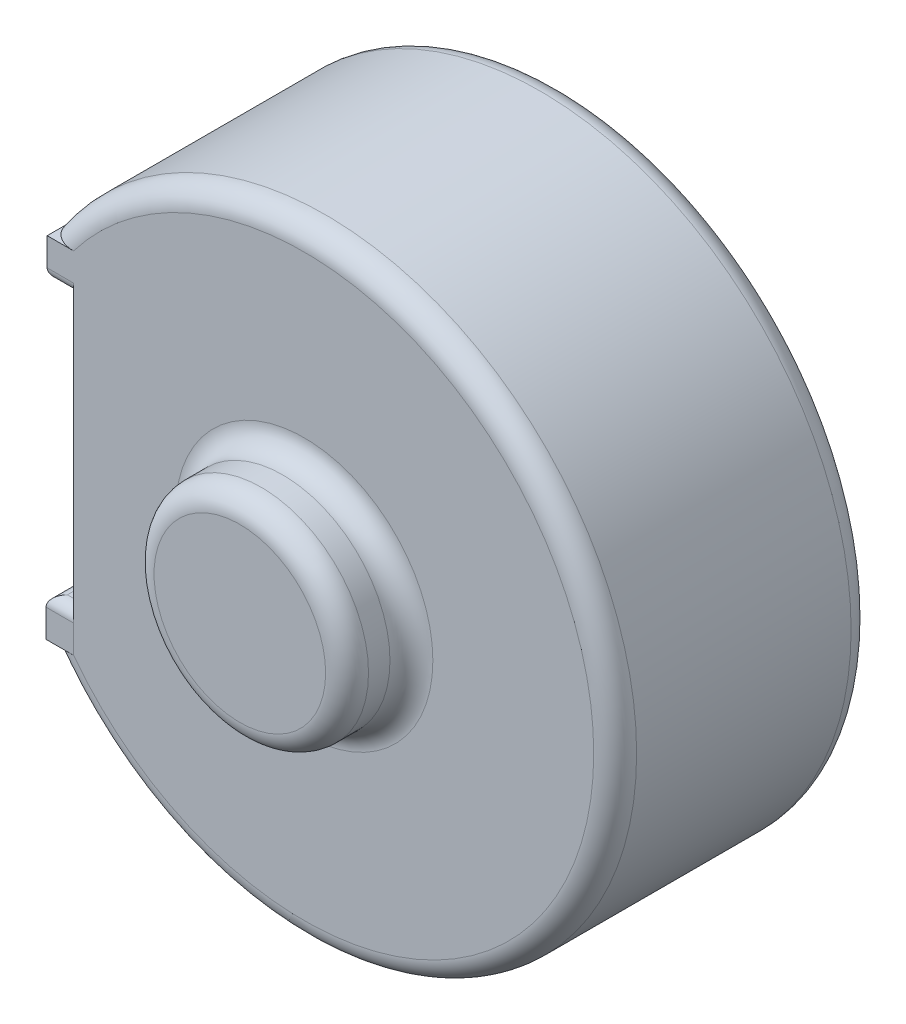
ISO-10303-21;
HEADER;
FILE_DESCRIPTION(('STEP AP214'),'2;1');
FILE_NAME('part.step','',(''),(''),'','','');
FILE_SCHEMA(('AUTOMOTIVE_DESIGN { 1 0 10303 214 1 1 1 1 }'));
ENDSEC;
DATA;
#1=APPLICATION_CONTEXT('core data for automotive mechanical design processes');
#2=APPLICATION_PROTOCOL_DEFINITION('international standard','automotive_design',2000,#1);
#3=PRODUCT_CONTEXT('',#1,'mechanical');
#4=PRODUCT('Part','Part','',(#3));
#5=PRODUCT_RELATED_PRODUCT_CATEGORY('part','',(#4));
#6=PRODUCT_DEFINITION_FORMATION('','',#4);
#7=PRODUCT_DEFINITION_CONTEXT('part definition',#1,'design');
#8=PRODUCT_DEFINITION('design','',#6,#7);
#9=PRODUCT_DEFINITION_SHAPE('','',#8);
#10=(LENGTH_UNIT() NAMED_UNIT(*) SI_UNIT(.MILLI.,.METRE.));
#11=(NAMED_UNIT(*) PLANE_ANGLE_UNIT() SI_UNIT($,.RADIAN.));
#12=(NAMED_UNIT(*) SI_UNIT($,.STERADIAN.) SOLID_ANGLE_UNIT());
#13=UNCERTAINTY_MEASURE_WITH_UNIT(LENGTH_MEASURE(1.E-05),#10,'distance_accuracy_value','');
#14=(GEOMETRIC_REPRESENTATION_CONTEXT(3) GLOBAL_UNCERTAINTY_ASSIGNED_CONTEXT((#13)) GLOBAL_UNIT_ASSIGNED_CONTEXT((#10,
#11,#12)) REPRESENTATION_CONTEXT('',''));
#15=CARTESIAN_POINT('',(0.,0.,0.));
#16=DIRECTION('',(0.,0.,1.));
#17=DIRECTION('',(1.,0.,0.));
#18=AXIS2_PLACEMENT_3D('',#15,#16,#17);
#19=CARTESIAN_POINT('',(0.,0.,5.08));
#20=DIRECTION('',(0.,0.,1.));
#21=DIRECTION('',(1.,0.,0.));
#22=AXIS2_PLACEMENT_3D('',#19,#20,#21);
#23=PLANE('',#22);
#24=CARTESIAN_POINT('',(0.,0.,5.08));
#25=DIRECTION('',(0.,0.,1.));
#26=DIRECTION('',(1.,0.,0.));
#27=AXIS2_PLACEMENT_3D('',#24,#25,#26);
#28=CIRCLE('',#27,7.874);
#29=CARTESIAN_POINT('',(7.874,0.,5.08));
#30=VERTEX_POINT('',#29);
#31=EDGE_CURVE('E460',#30,#30,#28,.T.);
#32=ORIENTED_EDGE('',*,*,#31,.F.);
#33=EDGE_LOOP('',(#32));
#34=FACE_BOUND('',#33,.T.);
#35=CARTESIAN_POINT('',(0.,0.,5.08));
#36=DIRECTION('',(0.,0.,1.));
#37=DIRECTION('',(1.,0.,0.));
#38=AXIS2_PLACEMENT_3D('',#35,#36,#37);
#39=CIRCLE('',#38,8.89);
#40=CARTESIAN_POINT('',(8.89,0.,5.08));
#41=VERTEX_POINT('',#40);
#42=EDGE_CURVE('E422',#41,#41,#39,.F.);
#43=ORIENTED_EDGE('',*,*,#42,.F.);
#44=EDGE_LOOP('',(#43));
#45=FACE_BOUND('',#44,.T.);
#46=ADVANCED_FACE('F36',(#34,#45),#23,.T.);
#47=CARTESIAN_POINT('',(-27.305,-20.7422533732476,-25.4));
#48=DIRECTION('',(1.,0.,0.));
#49=DIRECTION('',(0.,0.,-1.));
#50=AXIS2_PLACEMENT_3D('',#47,#48,#49);
#51=PLANE('',#50);
#52=DIRECTION('',(0.,0.,1.));
#53=VECTOR('',#52,1.);
#54=CARTESIAN_POINT('',(-27.305,16.1702533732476,5.08));
#55=LINE('',#54,#53);
#56=CARTESIAN_POINT('',(-27.305,16.1702533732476,1.27000000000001));
#57=VERTEX_POINT('',#56);
#58=CARTESIAN_POINT('',(-27.305,16.1702533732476,3.81000000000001));
#59=VERTEX_POINT('',#58);
#60=EDGE_CURVE('E296',#57,#59,#55,.T.);
#61=ORIENTED_EDGE('',*,*,#60,.F.);
#62=DIRECTION('',(0.,1.,0.));
#63=VECTOR('',#62,1.);
#64=CARTESIAN_POINT('',(-27.305,-20.7422533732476,1.27000000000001));
#65=LINE('',#64,#63);
#66=CARTESIAN_POINT('',(-27.305,-16.1702533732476,1.27000000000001));
#67=VERTEX_POINT('',#66);
#68=EDGE_CURVE('E401',#57,#67,#65,.F.);
#69=ORIENTED_EDGE('',*,*,#68,.T.);
#70=DIRECTION('',(0.,0.,-1.));
#71=VECTOR('',#70,1.);
#72=CARTESIAN_POINT('',(-27.305,-16.1702533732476,-25.4));
#73=LINE('',#72,#71);
#74=CARTESIAN_POINT('',(-27.305,-16.1702533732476,3.79740311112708));
#75=VERTEX_POINT('',#74);
#76=EDGE_CURVE('E114',#75,#67,#73,.T.);
#77=ORIENTED_EDGE('',*,*,#76,.F.);
#78=CARTESIAN_POINT('',(-27.305,-17.4402533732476,3.79740311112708));
#79=DIRECTION('',(1.,0.,0.));
#80=DIRECTION('',(0.,0.,-1.));
#81=AXIS2_PLACEMENT_3D('',#78,#79,#80);
#82=CIRCLE('',#81,1.27);
#83=CARTESIAN_POINT('',(-27.305,-17.4402533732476,5.06740311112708));
#84=VERTEX_POINT('',#83);
#85=EDGE_CURVE('E11',#75,#84,#82,.T.);
#86=ORIENTED_EDGE('',*,*,#85,.T.);
#87=DIRECTION('',(0.,-1.,0.));
#88=VECTOR('',#87,1.);
#89=CARTESIAN_POINT('',(-27.305,-16.1702533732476,5.06740311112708));
#90=LINE('',#89,#88);
#91=CARTESIAN_POINT('',(-27.305,-20.7422533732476,5.06740311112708));
#92=VERTEX_POINT('',#91);
#93=EDGE_CURVE('E109',#84,#92,#90,.T.);
#94=ORIENTED_EDGE('',*,*,#93,.T.);
#95=DIRECTION('',(0.,0.,1.));
#96=VECTOR('',#95,1.);
#97=CARTESIAN_POINT('',(-27.305,-20.7422533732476,-25.4));
#98=LINE('',#97,#96);
#99=CARTESIAN_POINT('',(-27.305,-20.7422533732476,5.08));
#100=VERTEX_POINT('',#99);
#101=EDGE_CURVE('E279',#92,#100,#98,.T.);
#102=ORIENTED_EDGE('',*,*,#101,.T.);
#103=DIRECTION('',(0.,1.,0.));
#104=VECTOR('',#103,1.);
#105=CARTESIAN_POINT('',(-27.305,-20.7422533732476,5.08));
#106=LINE('',#105,#104);
#107=CARTESIAN_POINT('',(-27.305,17.4402533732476,5.08));
#108=VERTEX_POINT('',#107);
#109=EDGE_CURVE('E281',#100,#108,#106,.T.);
#110=ORIENTED_EDGE('',*,*,#109,.T.);
#111=CARTESIAN_POINT('',(-27.305,17.4402533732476,3.81000000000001));
#112=DIRECTION('',(1.,0.,0.));
#113=DIRECTION('',(0.,0.,-1.));
#114=AXIS2_PLACEMENT_3D('',#111,#112,#113);
#115=CIRCLE('',#114,1.27);
#116=EDGE_CURVE('E45',#108,#59,#115,.T.);
#117=ORIENTED_EDGE('',*,*,#116,.T.);
#118=EDGE_LOOP('',(#61,#69,#77,#86,#94,#102,#110,#117));
#119=FACE_BOUND('',#118,.T.);
#120=ADVANCED_FACE('F106',(#119),#51,.F.);
#121=CARTESIAN_POINT('',(-46.355,-20.7422533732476,-25.4));
#122=DIRECTION('',(0.,-1.,0.));
#123=DIRECTION('',(0.,0.,-1.));
#124=AXIS2_PLACEMENT_3D('',#121,#122,#123);
#125=PLANE('',#124);
#126=DIRECTION('',(1.,0.,0.));
#127=VECTOR('',#126,1.);
#128=CARTESIAN_POINT('',(-46.355,-20.7422533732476,5.06740311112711));
#129=LINE('',#128,#127);
#130=CARTESIAN_POINT('',(-27.6216183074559,-20.7422533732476,5.06740311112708));
#131=VERTEX_POINT('',#130);
#132=EDGE_CURVE('E127',#131,#92,#129,.T.);
#133=ORIENTED_EDGE('',*,*,#132,.F.);
#134=CARTESIAN_POINT('',(-30.2212678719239,-20.7422533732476,3.46728291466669));
#135=CARTESIAN_POINT('',(-30.1586848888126,-20.7422533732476,3.59886267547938));
#136=CARTESIAN_POINT('',(-30.0834752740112,-20.7422533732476,3.72441551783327));
#137=CARTESIAN_POINT('',(-29.9122110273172,-20.7422533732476,3.9603223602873));
#138=CARTESIAN_POINT('',(-29.8161413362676,-20.7422533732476,4.07066528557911));
#139=CARTESIAN_POINT('',(-29.608339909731,-20.7422533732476,4.27375731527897));
#140=CARTESIAN_POINT('',(-29.4967181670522,-20.7422533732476,4.36662005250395));
#141=CARTESIAN_POINT('',(-29.2612479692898,-20.7422533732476,4.53508213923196));
#142=CARTESIAN_POINT('',(-29.1373991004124,-20.7422533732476,4.61068090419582));
#143=CARTESIAN_POINT('',(-28.8621018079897,-20.7422533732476,4.75439249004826));
#144=CARTESIAN_POINT('',(-28.7092573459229,-20.7422533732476,4.81982342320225));
#145=CARTESIAN_POINT('',(-28.3959284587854,-20.7422533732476,4.9286026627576));
#146=CARTESIAN_POINT('',(-28.2354394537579,-20.7422533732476,4.97193754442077));
#147=CARTESIAN_POINT('',(-27.880047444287,-20.7422533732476,5.04320059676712));
#148=CARTESIAN_POINT('',(-27.6842709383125,-20.7422533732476,5.06679494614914));
#149=CARTESIAN_POINT('',(-27.2912975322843,-20.7422533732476,5.08483729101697));
#150=CARTESIAN_POINT('',(-27.0940994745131,-20.7422533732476,5.07925799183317));
#151=CARTESIAN_POINT('',(-26.6776338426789,-20.7422533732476,5.03698570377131));
#152=CARTESIAN_POINT('',(-26.4587486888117,-20.7422533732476,4.9964263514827));
#153=CARTESIAN_POINT('',(-26.0308339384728,-20.7422533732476,4.87907226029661));
#154=CARTESIAN_POINT('',(-25.8218004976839,-20.7422533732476,4.80229178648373));
#155=CARTESIAN_POINT('',(-25.4635428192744,-20.7422533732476,4.63207259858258));
#156=CARTESIAN_POINT('',(-25.3110124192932,-20.7422533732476,4.54557953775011));
#157=CARTESIAN_POINT('',(-25.0217561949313,-20.7422533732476,4.34926151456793));
#158=CARTESIAN_POINT('',(-24.8850075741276,-20.7422533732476,4.23947087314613));
#159=CARTESIAN_POINT('',(-24.6614830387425,-20.7422533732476,4.02337535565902));
#160=CARTESIAN_POINT('',(-24.5703293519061,-20.7422533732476,3.92160685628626));
#161=CARTESIAN_POINT('',(-24.4056573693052,-20.7422533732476,3.70463460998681));
#162=CARTESIAN_POINT('',(-24.332118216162,-20.7422533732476,3.58944699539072));
#163=CARTESIAN_POINT('',(-24.2168655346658,-20.7422533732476,3.36636851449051));
#164=CARTESIAN_POINT('',(-24.1719835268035,-20.7422533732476,3.26012125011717));
#165=CARTESIAN_POINT('',(-24.1006086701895,-20.7422533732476,3.0415941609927));
#166=CARTESIAN_POINT('',(-24.0741049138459,-20.7422533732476,2.92931795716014));
#167=CARTESIAN_POINT('',(-24.0412669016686,-20.7422533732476,2.70140555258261));
#168=CARTESIAN_POINT('',(-24.0350047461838,-20.7422533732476,2.58575881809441));
#169=CARTESIAN_POINT('',(-24.0433410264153,-20.7422533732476,2.35522084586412));
#170=CARTESIAN_POINT('',(-24.0579402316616,-20.7422533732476,2.24032963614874));
#171=CARTESIAN_POINT('',(-24.1054788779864,-20.7422533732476,2.02136309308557));
#172=CARTESIAN_POINT('',(-24.1373220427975,-20.7422533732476,1.91704493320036));
#173=CARTESIAN_POINT('',(-24.2166611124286,-20.7422533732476,1.71459526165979));
#174=CARTESIAN_POINT('',(-24.2641596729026,-20.7422533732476,1.61646480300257));
#175=CARTESIAN_POINT('',(-24.3773472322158,-20.7422533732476,1.41955773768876));
#176=CARTESIAN_POINT('',(-24.4442782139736,-20.7422533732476,1.321499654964));
#177=CARTESIAN_POINT('',(-24.5910591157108,-20.7422533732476,1.13561157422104));
#178=CARTESIAN_POINT('',(-24.670919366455,-20.7422533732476,1.04778985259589));
#179=CARTESIAN_POINT('',(-24.8832129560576,-20.7422533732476,0.84184785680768));
#180=CARTESIAN_POINT('',(-25.0220687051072,-20.7422533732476,0.730319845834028));
#181=CARTESIAN_POINT('',(-25.3160135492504,-20.7422533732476,0.531237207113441));
#182=CARTESIAN_POINT('',(-25.4711294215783,-20.7422533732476,0.443723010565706));
#183=CARTESIAN_POINT('',(-25.7949356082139,-20.7422533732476,0.291121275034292));
#184=CARTESIAN_POINT('',(-25.9638009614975,-20.7422533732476,0.226407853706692));
#185=CARTESIAN_POINT('',(-26.3087282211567,-20.7422533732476,0.120999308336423));
#186=CARTESIAN_POINT('',(-26.4847884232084,-20.7422533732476,0.0802985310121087));
#187=CARTESIAN_POINT('',(-26.8765291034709,-20.7422533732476,0.0170397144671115));
#188=CARTESIAN_POINT('',(-27.0930783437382,-20.7422533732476,-0.000247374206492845));
#189=CARTESIAN_POINT('',(-27.5264281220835,-20.7422533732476,0.00025301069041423));
#190=CARTESIAN_POINT('',(-27.743228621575,-20.7422533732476,0.0180860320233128));
#191=CARTESIAN_POINT('',(-28.1787830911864,-20.7422533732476,0.0914542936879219));
#192=CARTESIAN_POINT('',(-28.3973116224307,-20.7422533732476,0.148362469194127));
#193=CARTESIAN_POINT('',(-28.8193632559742,-20.7422533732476,0.302967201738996));
#194=CARTESIAN_POINT('',(-29.0229195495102,-20.7422533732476,0.400570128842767));
#195=CARTESIAN_POINT('',(-29.344011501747,-20.7422533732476,0.599817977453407));
#196=CARTESIAN_POINT('',(-29.468422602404,-20.7422533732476,0.690469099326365));
#197=CARTESIAN_POINT('',(-29.7009639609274,-20.7422533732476,0.89097390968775));
#198=CARTESIAN_POINT('',(-29.8091018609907,-20.7422533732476,1.00081853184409));
#199=CARTESIAN_POINT('',(-29.9556109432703,-20.7422533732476,1.17922528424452));
#200=CARTESIAN_POINT('',(-30.0020200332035,-20.7422533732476,1.24130733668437));
#201=CARTESIAN_POINT('',(-30.0887120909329,-20.7422533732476,1.36959385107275));
#202=CARTESIAN_POINT('',(-30.1289984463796,-20.7422533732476,1.4357960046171));
#203=CARTESIAN_POINT('',(-30.2027720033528,-20.7422533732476,1.57185264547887));
#204=CARTESIAN_POINT('',(-30.2362629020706,-20.7422533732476,1.64170512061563));
#205=CARTESIAN_POINT('',(-30.2958564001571,-20.7422533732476,1.78446171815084));
#206=CARTESIAN_POINT('',(-30.3219604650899,-20.7422533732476,1.85736523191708));
#207=CARTESIAN_POINT('',(-30.3819458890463,-20.7422533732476,2.05813580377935));
#208=CARTESIAN_POINT('',(-30.4082488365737,-20.7422533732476,2.18837362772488));
#209=CARTESIAN_POINT('',(-30.4359450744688,-20.7422533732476,2.45137288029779));
#210=CARTESIAN_POINT('',(-30.4373507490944,-20.7422533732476,2.58413302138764));
#211=CARTESIAN_POINT('',(-30.4153646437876,-20.7422533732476,2.84588218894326));
#212=CARTESIAN_POINT('',(-30.3922860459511,-20.7422533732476,2.97489767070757));
#213=CARTESIAN_POINT('',(-30.3232805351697,-20.7422533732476,3.22665128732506));
#214=CARTESIAN_POINT('',(-30.2773427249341,-20.7422533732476,3.34938639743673));
#215=CARTESIAN_POINT('',(-30.2212678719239,-20.7422533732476,3.46728291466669));
#216=B_SPLINE_CURVE_WITH_KNOTS('',3,(#134,#135,#136,#137,#138,#139,#140,#141,#142,#143,#144,
#145,#146,#147,#148,#149,#150,#151,#152,#153,#154,#155,#156,#157,#158,#159,#160,#161,#162,#163,
#164,#165,#166,#167,#168,#169,#170,#171,#172,#173,#174,#175,#176,#177,#178,#179,#180,#181,#182,
#183,#184,#185,#186,#187,#188,#189,#190,#191,#192,#193,#194,#195,#196,#197,#198,#199,#200,#201,
#202,#203,#204,#205,#206,#207,#208,#209,#210,#211,#212,#213,#214,#215),.UNSPECIFIED.,.T.,.F.,(4,
2,2,2,2,2,2,2,2,2,2,2,2,2,2,2,2,2,2,2,2,2,2,2,2,2,2,2,2,2,2,2,2,2,2,2,2,2,2,2,4),(0.,
0.436534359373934,0.873384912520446,1.30728938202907,1.74120854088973,2.23814863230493,
2.73539028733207,3.32462866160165,3.91441842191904,4.57920906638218,5.24373811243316,
5.76788334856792,6.29126173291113,6.69962097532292,7.10749426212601,7.4520437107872,
7.79638849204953,8.14195848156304,8.48754121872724,8.81336614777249,9.13924637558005,
9.49410551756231,9.84924961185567,10.3806376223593,10.9129148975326,11.4535583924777,
11.9940745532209,12.642919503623,13.2926065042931,13.9663741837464,14.6386001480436,
15.0987067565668,15.5585966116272,15.7908394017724,16.0229532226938,16.2549404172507,
16.4868815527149,16.8830346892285,17.2789907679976,17.6699424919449,18.0610807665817),.UNSPECIFIED.);
#217=EDGE_CURVE('E425',#131,#100,#216,.T.);
#218=ORIENTED_EDGE('',*,*,#217,.T.);
#219=ORIENTED_EDGE('',*,*,#101,.F.);
#220=EDGE_LOOP('',(#133,#218,#219));
#221=FACE_BOUND('',#220,.T.);
#222=ADVANCED_FACE('F238',(#221),#125,.F.);
#223=CARTESIAN_POINT('',(0.,0.,0.));
#224=DIRECTION('',(0.,0.,1.));
#225=DIRECTION('',(1.,0.,0.));
#226=AXIS2_PLACEMENT_3D('',#223,#224,#225);
#227=CYLINDRICAL_SURFACE('',#226,36.83);
#228=DIRECTION('',(0.,0.,1.));
#229=VECTOR('',#228,1.);
#230=CARTESIAN_POINT('',(-30.4336626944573,-20.7422533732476,0.));
#231=LINE('',#230,#229);
#232=CARTESIAN_POINT('',(-30.4336626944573,-20.7422533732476,-22.86));
#233=VERTEX_POINT('',#232);
#234=CARTESIAN_POINT('',(-30.4336626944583,-20.7422533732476,2.54000000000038));
#235=VERTEX_POINT('',#234);
#236=EDGE_CURVE('E260',#233,#235,#231,.T.);
#237=ORIENTED_EDGE('',*,*,#236,.F.);
#238=CARTESIAN_POINT('',(0.,0.,-22.86));
#239=DIRECTION('',(0.,0.,-1.));
#240=DIRECTION('',(-1.,0.,0.));
#241=AXIS2_PLACEMENT_3D('',#238,#239,#240);
#242=CIRCLE('',#241,36.83);
#243=CARTESIAN_POINT('',(-30.4336626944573,20.7422533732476,-22.86));
#244=VERTEX_POINT('',#243);
#245=EDGE_CURVE('E448',#233,#244,#242,.F.);
#246=ORIENTED_EDGE('',*,*,#245,.T.);
#247=DIRECTION('',(0.,0.,1.));
#248=VECTOR('',#247,1.);
#249=CARTESIAN_POINT('',(-30.4336626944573,20.7422533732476,0.));
#250=LINE('',#249,#248);
#251=CARTESIAN_POINT('',(-30.4336626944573,20.7422533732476,2.54));
#252=VERTEX_POINT('',#251);
#253=EDGE_CURVE('E276',#252,#244,#250,.F.);
#254=ORIENTED_EDGE('',*,*,#253,.F.);
#255=CARTESIAN_POINT('',(0.,0.,2.54));
#256=DIRECTION('',(0.,0.,1.));
#257=DIRECTION('',(1.,0.,0.));
#258=AXIS2_PLACEMENT_3D('',#255,#256,#257);
#259=CIRCLE('',#258,36.83);
#260=EDGE_CURVE('E435',#252,#235,#259,.F.);
#261=ORIENTED_EDGE('',*,*,#260,.T.);
#262=EDGE_LOOP('',(#237,#246,#254,#261));
#263=FACE_BOUND('',#262,.T.);
#264=ADVANCED_FACE('F242',(#263),#227,.T.);
#265=CARTESIAN_POINT('',(0.,0.,-25.4));
#266=DIRECTION('',(0.,0.,1.));
#267=DIRECTION('',(1.,0.,0.));
#268=AXIS2_PLACEMENT_3D('',#265,#266,#267);
#269=CYLINDRICAL_SURFACE('',#268,31.75);
#270=CARTESIAN_POINT('',(0.,0.,0.));
#271=DIRECTION('',(0.,0.,-1.));
#272=DIRECTION('',(-1.,0.,0.));
#273=AXIS2_PLACEMENT_3D('',#270,#271,#272);
#274=CIRCLE('',#273,31.75);
#275=CARTESIAN_POINT('',(-27.3237150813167,16.1702533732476,0.));
#276=VERTEX_POINT('',#275);
#277=CARTESIAN_POINT('',(-27.3237150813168,-16.1702533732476,0.));
#278=VERTEX_POINT('',#277);
#279=EDGE_CURVE('E62',#276,#278,#274,.T.);
#280=ORIENTED_EDGE('',*,*,#279,.F.);
#281=DIRECTION('',(0.,0.,1.));
#282=VECTOR('',#281,1.);
#283=CARTESIAN_POINT('',(-27.3237150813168,16.1702533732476,-22.8599964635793));
#284=LINE('',#283,#282);
#285=CARTESIAN_POINT('',(-27.3237150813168,16.1702533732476,-22.86));
#286=VERTEX_POINT('',#285);
#287=EDGE_CURVE('E209',#286,#276,#284,.T.);
#288=ORIENTED_EDGE('',*,*,#287,.F.);
#289=CARTESIAN_POINT('',(0.,0.,-22.86));
#290=DIRECTION('',(0.,0.,-1.));
#291=DIRECTION('',(-1.,0.,0.));
#292=AXIS2_PLACEMENT_3D('',#289,#290,#291);
#293=CIRCLE('',#292,31.75);
#294=CARTESIAN_POINT('',(-27.3237150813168,-16.1702533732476,-22.8599982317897));
#295=VERTEX_POINT('',#294);
#296=EDGE_CURVE('E53',#286,#295,#293,.T.);
#297=ORIENTED_EDGE('',*,*,#296,.T.);
#298=DIRECTION('',(0.,0.,1.));
#299=VECTOR('',#298,1.);
#300=CARTESIAN_POINT('',(-27.3237150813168,-16.1702533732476,0.));
#301=LINE('',#300,#299);
#302=EDGE_CURVE('E384',#278,#295,#301,.F.);
#303=ORIENTED_EDGE('',*,*,#302,.F.);
#304=EDGE_LOOP('',(#280,#288,#297,#303));
#305=FACE_BOUND('',#304,.T.);
#306=ADVANCED_FACE('F167',(#305),#269,.F.);
#307=CARTESIAN_POINT('',(0.,0.,-22.86));
#308=DIRECTION('',(0.,0.,-1.));
#309=DIRECTION('',(-1.,0.,0.));
#310=AXIS2_PLACEMENT_3D('',#307,#308,#309);
#311=TOROIDAL_SURFACE('',#310,34.29,2.54);
#312=CARTESIAN_POINT('',(-27.305,-20.0209517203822,-25.3630885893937));
#313=CARTESIAN_POINT('',(-27.305,-20.2156948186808,-25.3829379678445));
#314=CARTESIAN_POINT('',(-27.305,-20.4112567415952,-25.3948949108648));
#315=CARTESIAN_POINT('',(-27.305,-20.8027878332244,-25.4024808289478));
#316=CARTESIAN_POINT('',(-27.305,-20.9987571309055,-25.3981034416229));
#317=CARTESIAN_POINT('',(-27.305,-21.3890359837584,-25.3720192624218));
#318=CARTESIAN_POINT('',(-27.305,-21.5833486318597,-25.350360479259));
#319=CARTESIAN_POINT('',(-27.305,-21.9688445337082,-25.2882856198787));
#320=CARTESIAN_POINT('',(-27.305,-22.1600304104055,-25.247886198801));
#321=CARTESIAN_POINT('',(-27.305,-22.5459205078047,-25.14385716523));
#322=CARTESIAN_POINT('',(-27.305,-22.740356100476,-25.0792094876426));
#323=CARTESIAN_POINT('',(-27.305,-23.1187193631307,-24.9240362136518));
#324=CARTESIAN_POINT('',(-27.305,-23.302657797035,-24.8335377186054));
#325=CARTESIAN_POINT('',(-27.305,-23.6140080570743,-24.6465829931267));
#326=CARTESIAN_POINT('',(-27.305,-23.7448849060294,-24.5559436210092));
#327=CARTESIAN_POINT('',(-27.305,-23.9909638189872,-24.3553186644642));
#328=CARTESIAN_POINT('',(-27.305,-24.1061922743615,-24.2453663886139));
#329=CARTESIAN_POINT('',(-27.305,-24.2860961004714,-24.0376559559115));
#330=CARTESIAN_POINT('',(-27.305,-24.3560517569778,-23.9444924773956));
#331=CARTESIAN_POINT('',(-27.305,-24.4801834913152,-23.7480871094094));
#332=CARTESIAN_POINT('',(-27.305,-24.5343687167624,-23.6448511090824));
#333=CARTESIAN_POINT('',(-27.305,-24.6236133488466,-23.4290830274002));
#334=CARTESIAN_POINT('',(-27.305,-24.6584799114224,-23.3164696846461));
#335=CARTESIAN_POINT('',(-27.305,-24.7049719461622,-23.0865459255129));
#336=CARTESIAN_POINT('',(-27.305,-24.7166226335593,-22.9692407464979));
#337=CARTESIAN_POINT('',(-27.305,-24.7156305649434,-22.7521711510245));
#338=CARTESIAN_POINT('',(-27.305,-24.7063247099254,-22.6523774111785));
#339=CARTESIAN_POINT('',(-27.305,-24.6707818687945,-22.4558757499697));
#340=CARTESIAN_POINT('',(-27.305,-24.6445436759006,-22.3591680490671));
#341=CARTESIAN_POINT('',(-27.305,-24.5774463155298,-22.1726380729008));
#342=CARTESIAN_POINT('',(-27.305,-24.5368053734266,-22.0827361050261));
#343=CARTESIAN_POINT('',(-27.305,-24.4431068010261,-21.9097142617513));
#344=CARTESIAN_POINT('',(-27.305,-24.3900441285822,-21.8265971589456));
#345=CARTESIAN_POINT('',(-27.305,-24.2441510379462,-21.6274497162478));
#346=CARTESIAN_POINT('',(-27.305,-24.1448191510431,-21.5161743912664));
#347=CARTESIAN_POINT('',(-27.305,-23.9296596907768,-21.3108985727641));
#348=CARTESIAN_POINT('',(-27.305,-23.8137923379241,-21.2169410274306));
#349=CARTESIAN_POINT('',(-27.305,-23.5138606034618,-21.0053593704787));
#350=CARTESIAN_POINT('',(-27.305,-23.3231948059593,-20.8971375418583));
#351=CARTESIAN_POINT('',(-27.305,-22.927530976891,-20.7115171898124));
#352=CARTESIAN_POINT('',(-27.305,-22.7225077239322,-20.6341745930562));
#353=CARTESIAN_POINT('',(-27.305,-22.3561313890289,-20.5222643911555));
#354=CARTESIAN_POINT('',(-27.305,-22.1965065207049,-20.4818494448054));
#355=CARTESIAN_POINT('',(-27.305,-21.8743023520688,-20.4149423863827));
#356=CARTESIAN_POINT('',(-27.305,-21.7117216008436,-20.3884573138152));
#357=CARTESIAN_POINT('',(-27.305,-21.3847941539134,-20.348339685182));
#358=CARTESIAN_POINT('',(-27.305,-21.2204453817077,-20.3347244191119));
#359=CARTESIAN_POINT('',(-27.305,-20.8912361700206,-20.3195975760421));
#360=CARTESIAN_POINT('',(-27.305,-20.7263758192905,-20.3180840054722));
#361=CARTESIAN_POINT('',(-27.305,-20.390408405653,-20.3267592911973));
#362=CARTESIAN_POINT('',(-27.305,-20.219313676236,-20.3374159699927));
#363=CARTESIAN_POINT('',(-27.305,-19.8782854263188,-20.3708391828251));
#364=CARTESIAN_POINT('',(-27.305,-19.708352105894,-20.3936077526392));
#365=CARTESIAN_POINT('',(-27.305,-19.370740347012,-20.4511495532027));
#366=CARTESIAN_POINT('',(-27.305,-19.2030594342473,-20.4859082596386));
#367=CARTESIAN_POINT('',(-27.305,-18.870740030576,-20.5676803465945));
#368=CARTESIAN_POINT('',(-27.305,-18.7061004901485,-20.6146894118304));
#369=CARTESIAN_POINT('',(-27.305,-18.438215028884,-20.7028256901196));
#370=CARTESIAN_POINT('',(-27.305,-18.3337294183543,-20.7402130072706));
#371=CARTESIAN_POINT('',(-27.305,-18.1269978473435,-20.8207210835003));
#372=CARTESIAN_POINT('',(-27.305,-18.0247514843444,-20.8638408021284));
#373=CARTESIAN_POINT('',(-27.305,-17.8230882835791,-20.9562123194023));
#374=CARTESIAN_POINT('',(-27.305,-17.723670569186,-21.0054621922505));
#375=CARTESIAN_POINT('',(-27.305,-17.5284605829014,-21.1106421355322));
#376=CARTESIAN_POINT('',(-27.305,-17.4326671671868,-21.1665700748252));
#377=CARTESIAN_POINT('',(-27.305,-17.2113790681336,-21.3077573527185));
#378=CARTESIAN_POINT('',(-27.305,-17.0879044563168,-21.396243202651));
#379=CARTESIAN_POINT('',(-27.305,-16.8542335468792,-21.5893943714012));
#380=CARTESIAN_POINT('',(-27.305,-16.7440116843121,-21.6940276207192));
#381=CARTESIAN_POINT('',(-27.305,-16.5804525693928,-21.881144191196));
#382=CARTESIAN_POINT('',(-27.305,-16.5208819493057,-21.9581353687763));
#383=CARTESIAN_POINT('',(-27.305,-16.4137811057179,-22.1201348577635));
#384=CARTESIAN_POINT('',(-27.305,-16.3662324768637,-22.2051306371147));
#385=CARTESIAN_POINT('',(-27.305,-16.2948697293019,-22.3652885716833));
#386=CARTESIAN_POINT('',(-27.305,-16.2682463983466,-22.4391843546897));
#387=CARTESIAN_POINT('',(-27.305,-16.2276993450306,-22.5903899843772));
#388=CARTESIAN_POINT('',(-27.305,-16.2137625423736,-22.667696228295));
#389=CARTESIAN_POINT('',(-27.305,-16.1999725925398,-22.8239233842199));
#390=CARTESIAN_POINT('',(-27.305,-16.2001804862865,-22.9028498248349));
#391=CARTESIAN_POINT('',(-27.305,-16.2148126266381,-23.0593778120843));
#392=CARTESIAN_POINT('',(-27.305,-16.2292436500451,-23.1369787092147));
#393=CARTESIAN_POINT('',(-27.305,-16.2696304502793,-23.2842886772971));
#394=CARTESIAN_POINT('',(-27.305,-16.2948839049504,-23.3541955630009));
#395=CARTESIAN_POINT('',(-27.305,-16.3548247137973,-23.4897822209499));
#396=CARTESIAN_POINT('',(-27.305,-16.3895152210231,-23.5554605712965));
#397=CARTESIAN_POINT('',(-27.305,-16.4930871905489,-23.7260391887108));
#398=CARTESIAN_POINT('',(-27.305,-16.569020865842,-23.8266453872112));
#399=CARTESIAN_POINT('',(-27.305,-16.7353819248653,-24.0151413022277));
#400=CARTESIAN_POINT('',(-27.305,-16.8258580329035,-24.1029863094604));
#401=CARTESIAN_POINT('',(-27.305,-17.0036940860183,-24.2561603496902));
#402=CARTESIAN_POINT('',(-27.305,-17.0898360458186,-24.3229286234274));
#403=CARTESIAN_POINT('',(-27.305,-17.2675515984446,-24.4488695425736));
#404=CARTESIAN_POINT('',(-27.305,-17.359129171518,-24.5080365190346));
#405=CARTESIAN_POINT('',(-27.305,-17.5464463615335,-24.6195768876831));
#406=CARTESIAN_POINT('',(-27.305,-17.6421907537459,-24.6719421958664));
#407=CARTESIAN_POINT('',(-27.305,-17.8368505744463,-24.7704289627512));
#408=CARTESIAN_POINT('',(-27.305,-17.9357669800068,-24.8165484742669));
#409=CARTESIAN_POINT('',(-27.305,-18.1930227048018,-24.9275894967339));
#410=CARTESIAN_POINT('',(-27.305,-18.3531867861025,-24.988301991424));
#411=CARTESIAN_POINT('',(-27.305,-18.6778674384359,-25.0967766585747));
#412=CARTESIAN_POINT('',(-27.305,-18.8423861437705,-25.1445323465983));
#413=CARTESIAN_POINT('',(-27.305,-19.1747702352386,-25.2278144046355));
#414=CARTESIAN_POINT('',(-27.305,-19.3426407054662,-25.2633204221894));
#415=CARTESIAN_POINT('',(-27.305,-19.680448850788,-25.3222641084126));
#416=CARTESIAN_POINT('',(-27.305,-19.8503862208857,-25.3457035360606));
#417=CARTESIAN_POINT('',(-27.305,-20.0209517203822,-25.3630885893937));
#418=B_SPLINE_CURVE_WITH_KNOTS('',3,(#312,#313,#314,#315,#316,#317,#318,#319,#320,#321,#322,
#323,#324,#325,#326,#327,#328,#329,#330,#331,#332,#333,#334,#335,#336,#337,#338,#339,#340,#341,
#342,#343,#344,#345,#346,#347,#348,#349,#350,#351,#352,#353,#354,#355,#356,#357,#358,#359,#360,
#361,#362,#363,#364,#365,#366,#367,#368,#369,#370,#371,#372,#373,#374,#375,#376,#377,#378,#379,
#380,#381,#382,#383,#384,#385,#386,#387,#388,#389,#390,#391,#392,#393,#394,#395,#396,#397,#398,
#399,#400,#401,#402,#403,#404,#405,#406,#407,#408,#409,#410,#411,#412,#413,#414,#415,#416,#417),
.UNSPECIFIED.,.T.,.F.,(4,2,2,2,2,2,2,2,2,2,2,2,2,2,2,2,2,2,2,2,2,2,2,2,2,2,2,2,2,2,2,2,2,2,2,2,
2,2,2,2,2,2,2,2,2,2,2,2,2,2,2,2,4),(0.,0.587112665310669,1.17445404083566,1.76016940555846,
2.34536522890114,2.9585324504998,3.57105918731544,4.04715276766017,4.52243316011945,
4.87068993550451,5.21874430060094,5.57021316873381,5.92130009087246,6.22048226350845,
6.51968576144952,6.81453710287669,7.10950833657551,7.55447026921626,8.00052128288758,
8.65462361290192,9.30990529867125,9.80325870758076,10.2968611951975,10.79112587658,
11.2853091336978,11.7991470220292,12.313071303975,12.8263752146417,13.3394985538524,
13.6722724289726,14.004985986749,14.3375952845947,14.6700987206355,15.1247790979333,
15.5785678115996,15.8698004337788,16.1605844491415,16.3952692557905,16.6297118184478,
16.8651661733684,17.1007327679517,17.3228984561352,17.5451384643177,17.9211024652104,
18.2983534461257,18.6248575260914,18.951603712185,19.27873476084,19.6059675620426,
20.1191590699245,20.6326069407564,21.1469038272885,21.661125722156),.UNSPECIFIED.);
#419=CARTESIAN_POINT('',(-27.305,-17.4402533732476,-24.5563151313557));
#420=VERTEX_POINT('',#419);
#421=CARTESIAN_POINT('',(-27.305,-20.7422533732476,-25.4));
#422=VERTEX_POINT('',#421);
#423=EDGE_CURVE('E184',#420,#422,#418,.T.);
#424=ORIENTED_EDGE('',*,*,#423,.F.);
#425=CARTESIAN_POINT('',(-27.305,-17.4402533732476,-24.5563151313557));
#426=CARTESIAN_POINT('',(-27.3050410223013,-17.3903426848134,-24.5264813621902));
#427=CARTESIAN_POINT('',(-27.3079489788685,-17.3396592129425,-24.4973997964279));
#428=CARTESIAN_POINT('',(-27.3203793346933,-17.236260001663,-24.4427171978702));
#429=CARTESIAN_POINT('',(-27.3300036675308,-17.1835249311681,-24.4171771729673));
#430=CARTESIAN_POINT('',(-27.3539064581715,-17.0885846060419,-24.3774367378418));
#431=CARTESIAN_POINT('',(-27.3667326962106,-17.0465623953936,-24.3619786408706));
#432=CARTESIAN_POINT('',(-27.3973294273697,-16.9627953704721,-24.3368376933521));
#433=CARTESIAN_POINT('',(-27.4150717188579,-16.9210503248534,-24.3271228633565));
#434=CARTESIAN_POINT('',(-27.4557199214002,-16.8383813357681,-24.3147547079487));
#435=CARTESIAN_POINT('',(-27.4786822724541,-16.7974721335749,-24.3121829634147));
#436=CARTESIAN_POINT('',(-27.528900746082,-16.7186118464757,-24.3148358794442));
#437=CARTESIAN_POINT('',(-27.5561614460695,-16.6806639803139,-24.3200689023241));
#438=CARTESIAN_POINT('',(-27.6158144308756,-16.6064086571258,-24.3380001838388));
#439=CARTESIAN_POINT('',(-27.6484343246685,-16.5704128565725,-24.3512058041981));
#440=CARTESIAN_POINT('',(-27.7160295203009,-16.5035887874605,-24.3834290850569));
#441=CARTESIAN_POINT('',(-27.7510104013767,-16.4727734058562,-24.4024609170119));
#442=CARTESIAN_POINT('',(-27.8425235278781,-16.4003300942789,-24.4560481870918));
#443=CARTESIAN_POINT('',(-27.9002114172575,-16.3622341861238,-24.4933470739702));
#444=CARTESIAN_POINT('',(-28.0185916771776,-16.2966168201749,-24.5723473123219));
#445=CARTESIAN_POINT('',(-28.0792926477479,-16.2691278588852,-24.614061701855));
#446=CARTESIAN_POINT('',(-28.1760761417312,-16.2339681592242,-24.6802759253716));
#447=CARTESIAN_POINT('',(-28.211283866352,-16.2228925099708,-24.7043045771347));
#448=CARTESIAN_POINT('',(-28.2824854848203,-16.2038495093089,-24.7524441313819));
#449=CARTESIAN_POINT('',(-28.3184794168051,-16.1958823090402,-24.7765550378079));
#450=CARTESIAN_POINT('',(-28.3908802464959,-16.1831376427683,-24.8243181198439));
#451=CARTESIAN_POINT('',(-28.4272810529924,-16.1783336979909,-24.8479724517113));
#452=CARTESIAN_POINT('',(-28.5007006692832,-16.1718948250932,-24.8947487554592));
#453=CARTESIAN_POINT('',(-28.5377195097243,-16.1702600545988,-24.9178707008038));
#454=CARTESIAN_POINT('',(-28.5750000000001,-16.1702533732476,-24.9405845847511));
#455=B_SPLINE_CURVE_WITH_KNOTS('',3,(#425,#426,#427,#428,#429,#430,#431,#432,#433,#434,#435,
#436,#437,#438,#439,#440,#441,#442,#443,#444,#445,#446,#447,#448,#449,#450,#451,#452,#453,#454),
.UNSPECIFIED.,.F.,.F.,(4,2,2,2,2,2,2,2,2,2,2,2,2,2,4),(0.,0.174812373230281,0.352337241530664,
0.491559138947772,0.629998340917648,0.770012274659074,0.91017633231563,1.0603694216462,
1.21093077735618,1.44531746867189,1.68041665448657,1.81243907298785,1.94446790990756,
2.07537702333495,2.20629264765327),.UNSPECIFIED.);
#456=CARTESIAN_POINT('',(-28.575,-16.1702533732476,-24.9405845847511));
#457=VERTEX_POINT('',#456);
#458=EDGE_CURVE('E138',#420,#457,#455,.T.);
#459=ORIENTED_EDGE('',*,*,#458,.T.);
#460=CARTESIAN_POINT('',(-27.3237150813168,-16.1702533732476,-22.8599982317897));
#461=CARTESIAN_POINT('',(-27.3237014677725,-16.1702533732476,-22.9245174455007));
#462=CARTESIAN_POINT('',(-27.3265711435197,-16.1702533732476,-22.9890298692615));
#463=CARTESIAN_POINT('',(-27.3379731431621,-16.1702533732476,-23.1175293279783));
#464=CARTESIAN_POINT('',(-27.3465033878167,-16.1702533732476,-23.1815165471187));
#465=CARTESIAN_POINT('',(-27.3690684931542,-16.1702533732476,-23.3081973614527));
#466=CARTESIAN_POINT('',(-27.3830767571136,-16.1702533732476,-23.370895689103));
#467=CARTESIAN_POINT('',(-27.4163953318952,-16.1702533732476,-23.4948520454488));
#468=CARTESIAN_POINT('',(-27.4357059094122,-16.1702533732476,-23.5561100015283));
#469=CARTESIAN_POINT('',(-27.5011976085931,-16.1702533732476,-23.7369584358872));
#470=CARTESIAN_POINT('',(-27.5549855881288,-16.1702533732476,-23.8538803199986));
#471=CARTESIAN_POINT('',(-27.6804141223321,-16.1702533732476,-24.0777560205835));
#472=CARTESIAN_POINT('',(-27.7520779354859,-16.1702533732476,-24.1846965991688));
#473=CARTESIAN_POINT('',(-27.9150354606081,-16.1702533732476,-24.3924493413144));
#474=CARTESIAN_POINT('',(-28.0072159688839,-16.1702533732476,-24.4925635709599));
#475=CARTESIAN_POINT('',(-28.2052018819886,-16.1702533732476,-24.6779804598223));
#476=CARTESIAN_POINT('',(-28.3109936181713,-16.1702533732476,-24.7632977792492));
#477=CARTESIAN_POINT('',(-28.4720464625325,-16.1702533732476,-24.8756659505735));
#478=CARTESIAN_POINT('',(-28.5230540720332,-16.1702533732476,-24.908931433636));
#479=CARTESIAN_POINT('',(-28.5750000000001,-16.1702533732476,-24.9405845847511));
#480=B_SPLINE_CURVE_WITH_KNOTS('',3,(#460,#461,#462,#463,#464,#465,#466,#467,#468,#469,#470,
#471,#472,#473,#474,#475,#476,#477,#478,#479),.UNSPECIFIED.,.F.,.F.,(4,2,2,2,2,2,2,2,2,4),(0.,
0.193482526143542,0.386894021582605,0.579377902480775,0.771871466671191,1.15608533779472,
1.54080174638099,1.94747143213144,2.35373587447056,2.53628770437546),.UNSPECIFIED.);
#481=EDGE_CURVE('E191',#295,#457,#480,.T.);
#482=ORIENTED_EDGE('',*,*,#481,.F.);
#483=ORIENTED_EDGE('',*,*,#296,.F.);
#484=CARTESIAN_POINT('',(-28.575,16.1702533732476,-24.9405845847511));
#485=CARTESIAN_POINT('',(-28.5101971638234,16.1702533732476,-24.9010842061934));
#486=CARTESIAN_POINT('',(-28.4469147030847,16.1702533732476,-24.859134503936));
#487=CARTESIAN_POINT('',(-28.3237943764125,16.1702533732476,-24.7703793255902));
#488=CARTESIAN_POINT('',(-28.2639587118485,16.1702533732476,-24.7235707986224));
#489=CARTESIAN_POINT('',(-28.0897180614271,16.1702533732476,-24.5754647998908));
#490=CARTESIAN_POINT('',(-27.9812961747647,16.1702533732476,-24.466918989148));
#491=CARTESIAN_POINT('',(-27.7846107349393,16.1702533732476,-24.2319599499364));
#492=CARTESIAN_POINT('',(-27.6964437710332,16.1702533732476,-24.1054655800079));
#493=CARTESIAN_POINT('',(-27.5459018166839,16.1702533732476,-23.8385232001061));
#494=CARTESIAN_POINT('',(-27.4834109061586,16.1702533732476,-23.6981415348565));
#495=CARTESIAN_POINT('',(-27.3989742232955,16.1702533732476,-23.4416439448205));
#496=CARTESIAN_POINT('',(-27.3709690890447,16.1702533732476,-23.3275130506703));
#497=CARTESIAN_POINT('',(-27.3427299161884,16.1702533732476,-23.1538066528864));
#498=CARTESIAN_POINT('',(-27.335611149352,16.1702533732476,-23.0952947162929));
#499=CARTESIAN_POINT('',(-27.3260999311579,16.1702533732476,-22.9778619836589));
#500=CARTESIAN_POINT('',(-27.3237095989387,16.1702533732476,-22.9189410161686));
#501=CARTESIAN_POINT('',(-27.3237150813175,16.1702533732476,-22.8599982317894));
#502=B_SPLINE_CURVE_WITH_KNOTS('',3,(#484,#485,#486,#487,#488,#489,#490,#491,#492,#493,#494,
#495,#496,#497,#498,#499,#500,#501),.UNSPECIFIED.,.F.,.F.,(4,2,2,2,2,2,2,2,4),(0.,
0.227567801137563,0.455279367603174,0.913184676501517,1.37323024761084,1.83117539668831,
2.18222189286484,2.35888035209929,2.53561796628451),.UNSPECIFIED.);
#503=CARTESIAN_POINT('',(-28.575,16.1702533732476,-24.9405845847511));
#504=VERTEX_POINT('',#503);
#505=EDGE_CURVE('E200',#504,#286,#502,.T.);
#506=ORIENTED_EDGE('',*,*,#505,.F.);
#507=CARTESIAN_POINT('',(-28.575,16.1702533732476,-24.9405845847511));
#508=CARTESIAN_POINT('',(-28.5290399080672,16.1702700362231,-24.9125909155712));
#509=CARTESIAN_POINT('',(-28.4834867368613,16.1727481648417,-24.8839705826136));
#510=CARTESIAN_POINT('',(-28.3933195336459,16.1824932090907,-24.8260004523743));
#511=CARTESIAN_POINT('',(-28.3487061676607,16.1897634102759,-24.796650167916));
#512=CARTESIAN_POINT('',(-28.2601142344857,16.209065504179,-24.7374543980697));
#513=CARTESIAN_POINT('',(-28.2161483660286,16.2211497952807,-24.7076070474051));
#514=CARTESIAN_POINT('',(-28.1294833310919,16.2500849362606,-24.6484400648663));
#515=CARTESIAN_POINT('',(-28.0867834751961,16.2669331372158,-24.6191201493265));
#516=CARTESIAN_POINT('',(-27.9933610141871,16.3098555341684,-24.5554735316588));
#517=CARTESIAN_POINT('',(-27.9429611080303,16.3371474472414,-24.5214798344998));
#518=CARTESIAN_POINT('',(-27.8445552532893,16.3997085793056,-24.4578604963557));
#519=CARTESIAN_POINT('',(-27.7965412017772,16.4349481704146,-24.4282192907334));
#520=CARTESIAN_POINT('',(-27.717639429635,16.5023559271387,-24.384482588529));
#521=CARTESIAN_POINT('',(-27.6859453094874,16.5322581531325,-24.3683930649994));
#522=CARTESIAN_POINT('',(-27.6247981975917,16.5964679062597,-24.3416609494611));
#523=CARTESIAN_POINT('',(-27.5953414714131,16.6307678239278,-24.3310091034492));
#524=CARTESIAN_POINT('',(-27.539368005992,16.7037103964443,-24.3166065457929));
#525=CARTESIAN_POINT('',(-27.5128865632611,16.742396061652,-24.3129318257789));
#526=CARTESIAN_POINT('',(-27.46442663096,16.8224237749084,-24.3134197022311));
#527=CARTESIAN_POINT('',(-27.4424461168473,16.8637646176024,-24.3175787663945));
#528=CARTESIAN_POINT('',(-27.4062520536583,16.9417320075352,-24.3318814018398));
#529=CARTESIAN_POINT('',(-27.3913882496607,16.9782332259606,-24.3411321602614));
#530=CARTESIAN_POINT('',(-27.3653853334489,17.051352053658,-24.3638672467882));
#531=CARTESIAN_POINT('',(-27.3542595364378,17.0879696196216,-24.3773663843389));
#532=CARTESIAN_POINT('',(-27.3310029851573,17.178528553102,-24.4148403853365));
#533=CARTESIAN_POINT('',(-27.321017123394,17.2322302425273,-24.4407165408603));
#534=CARTESIAN_POINT('',(-27.3112772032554,17.3114028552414,-24.4823990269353));
#535=CARTESIAN_POINT('',(-27.3089027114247,17.3374319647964,-24.4966896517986));
#536=CARTESIAN_POINT('',(-27.3057680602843,17.3891081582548,-24.5260033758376));
#537=CARTESIAN_POINT('',(-27.3050047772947,17.4147558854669,-24.5410249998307));
#538=CARTESIAN_POINT('',(-27.305,17.4402533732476,-24.5563151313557));
#539=B_SPLINE_CURVE_WITH_KNOTS('',3,(#507,#508,#509,#510,#511,#512,#513,#514,#515,#516,#517,
#518,#519,#520,#521,#522,#523,#524,#525,#526,#527,#528,#529,#530,#531,#532,#533,#534,#535,#536,
#537,#538),.UNSPECIFIED.,.F.,.F.,(4,2,2,2,2,2,2,2,2,2,2,2,2,2,2,4),(0.,0.16135126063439,
0.32281326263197,0.486082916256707,0.649261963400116,0.84865675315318,1.04732016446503,
1.18621111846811,1.32486490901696,1.46502037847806,1.60511266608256,1.72611315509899,
1.84754020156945,2.02804800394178,2.11737801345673,2.20653467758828),.UNSPECIFIED.);
#540=CARTESIAN_POINT('',(-27.305,17.4402533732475,-24.5563151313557));
#541=VERTEX_POINT('',#540);
#542=EDGE_CURVE('E81',#504,#541,#539,.T.);
#543=ORIENTED_EDGE('',*,*,#542,.T.);
#544=CARTESIAN_POINT('',(-27.305,16.2085293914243,-22.9916943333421));
#545=CARTESIAN_POINT('',(-27.305,16.2009238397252,-22.9169182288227));
#546=CARTESIAN_POINT('',(-27.305,16.1997992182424,-22.8414750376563));
#547=CARTESIAN_POINT('',(-27.305,16.2106181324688,-22.6915292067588));
#548=CARTESIAN_POINT('',(-27.305,16.2225655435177,-22.6170268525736));
#549=CARTESIAN_POINT('',(-27.305,16.258275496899,-22.4713933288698));
#550=CARTESIAN_POINT('',(-27.305,16.2819753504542,-22.4002464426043));
#551=CARTESIAN_POINT('',(-27.305,16.3393013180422,-22.2621145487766));
#552=CARTESIAN_POINT('',(-27.305,16.3729334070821,-22.1951320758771));
#553=CARTESIAN_POINT('',(-27.305,16.4719108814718,-22.0250776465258));
#554=CARTESIAN_POINT('',(-27.305,16.5438823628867,-21.9258759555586));
#555=CARTESIAN_POINT('',(-27.305,16.7021949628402,-21.7396422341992));
#556=CARTESIAN_POINT('',(-27.305,16.7885810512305,-21.6526499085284));
#557=CARTESIAN_POINT('',(-27.305,16.9582573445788,-21.5011473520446));
#558=CARTESIAN_POINT('',(-27.305,17.04028301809,-21.435195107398));
#559=CARTESIAN_POINT('',(-27.305,17.2097157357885,-21.3105411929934));
#560=CARTESIAN_POINT('',(-27.305,17.2971266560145,-21.251844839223));
#561=CARTESIAN_POINT('',(-27.305,17.4761079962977,-21.1409299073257));
#562=CARTESIAN_POINT('',(-27.305,17.5676841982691,-21.0887207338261));
#563=CARTESIAN_POINT('',(-27.305,17.7540031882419,-20.9902702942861));
#564=CARTESIAN_POINT('',(-27.305,17.8487470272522,-20.9440310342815));
#565=CARTESIAN_POINT('',(-27.305,18.1080389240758,-20.8265619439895));
#566=CARTESIAN_POINT('',(-27.305,18.2749588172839,-20.760538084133));
#567=CARTESIAN_POINT('',(-27.305,18.6138243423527,-20.6428517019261));
#568=CARTESIAN_POINT('',(-27.305,18.7857732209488,-20.5911986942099));
#569=CARTESIAN_POINT('',(-27.305,19.1334464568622,-20.501373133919));
#570=CARTESIAN_POINT('',(-27.305,19.3091765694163,-20.4632229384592));
#571=CARTESIAN_POINT('',(-27.305,19.6629416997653,-20.4001813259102));
#572=CARTESIAN_POINT('',(-27.305,19.8409761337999,-20.3752866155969));
#573=CARTESIAN_POINT('',(-27.305,20.2057763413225,-20.3380409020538));
#574=CARTESIAN_POINT('',(-27.305,20.3925996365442,-20.3262489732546));
#575=CARTESIAN_POINT('',(-27.305,20.7666601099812,-20.3175433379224));
#576=CARTESIAN_POINT('',(-27.305,20.9538973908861,-20.3206338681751));
#577=CARTESIAN_POINT('',(-27.305,21.3269953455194,-20.342537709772));
#578=CARTESIAN_POINT('',(-27.305,21.5128583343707,-20.3613100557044));
#579=CARTESIAN_POINT('',(-27.305,21.8819991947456,-20.4157749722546));
#580=CARTESIAN_POINT('',(-27.305,22.0652787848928,-20.4514556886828));
#581=CARTESIAN_POINT('',(-27.305,22.4515455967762,-20.5474647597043));
#582=CARTESIAN_POINT('',(-27.305,22.653889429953,-20.6104517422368));
#583=CARTESIAN_POINT('',(-27.305,23.0481397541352,-20.7636127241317));
#584=CARTESIAN_POINT('',(-27.305,23.2400564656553,-20.8537595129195));
#585=CARTESIAN_POINT('',(-27.305,23.5628412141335,-21.0400925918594));
#586=CARTESIAN_POINT('',(-27.305,23.6974146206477,-21.129811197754));
#587=CARTESIAN_POINT('',(-27.305,23.9511131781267,-21.3290680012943));
#588=CARTESIAN_POINT('',(-27.305,24.0702630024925,-21.4385738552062));
#589=CARTESIAN_POINT('',(-27.305,24.2569403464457,-21.6459417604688));
#590=CARTESIAN_POINT('',(-27.305,24.3297394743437,-21.7390386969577));
#591=CARTESIAN_POINT('',(-27.305,24.4595407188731,-21.9357056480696));
#592=CARTESIAN_POINT('',(-27.305,24.5165627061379,-22.0392622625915));
#593=CARTESIAN_POINT('',(-27.305,24.6039143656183,-22.2390555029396));
#594=CARTESIAN_POINT('',(-27.305,24.6369469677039,-22.3341036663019));
#595=CARTESIAN_POINT('',(-27.305,24.6865805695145,-22.5284179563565));
#596=CARTESIAN_POINT('',(-27.305,24.7031905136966,-22.6276817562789));
#597=CARTESIAN_POINT('',(-27.305,24.7187555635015,-22.8278596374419));
#598=CARTESIAN_POINT('',(-27.305,24.7176654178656,-22.9287772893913));
#599=CARTESIAN_POINT('',(-27.305,24.6978070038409,-23.1288495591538));
#600=CARTESIAN_POINT('',(-27.305,24.6790355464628,-23.2280038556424));
#601=CARTESIAN_POINT('',(-27.305,24.6261950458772,-23.4182422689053));
#602=CARTESIAN_POINT('',(-27.305,24.592699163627,-23.5094883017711));
#603=CARTESIAN_POINT('',(-27.305,24.5125922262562,-23.685976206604));
#604=CARTESIAN_POINT('',(-27.305,24.465976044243,-23.7712157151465));
#605=CARTESIAN_POINT('',(-27.305,24.3391650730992,-23.9702121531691));
#606=CARTESIAN_POINT('',(-27.305,24.253178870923,-24.0802819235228));
#607=CARTESIAN_POINT('',(-27.305,24.0646282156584,-24.2851662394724));
#608=CARTESIAN_POINT('',(-27.305,23.9620272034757,-24.3799462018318));
#609=CARTESIAN_POINT('',(-27.305,23.6968925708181,-24.5933919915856));
#610=CARTESIAN_POINT('',(-27.305,23.5279403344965,-24.7040461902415));
#611=CARTESIAN_POINT('',(-27.305,23.1750100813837,-24.8977269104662));
#612=CARTESIAN_POINT('',(-27.305,22.9910068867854,-24.9807059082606));
#613=CARTESIAN_POINT('',(-27.305,22.659803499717,-25.1050895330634));
#614=CARTESIAN_POINT('',(-27.305,22.5145019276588,-25.1516963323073));
#615=CARTESIAN_POINT('',(-27.305,22.2203598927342,-25.2321767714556));
#616=CARTESIAN_POINT('',(-27.305,22.0715177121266,-25.2660440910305));
#617=CARTESIAN_POINT('',(-27.305,21.7713850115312,-25.3220862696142));
#618=CARTESIAN_POINT('',(-27.305,21.620090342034,-25.3442385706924));
#619=CARTESIAN_POINT('',(-27.305,21.3163342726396,-25.3775650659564));
#620=CARTESIAN_POINT('',(-27.305,21.163872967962,-25.3887401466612));
#621=CARTESIAN_POINT('',(-27.305,20.8116453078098,-25.4025862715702));
#622=CARTESIAN_POINT('',(-27.305,20.6117299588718,-25.4015918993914));
#623=CARTESIAN_POINT('',(-27.305,20.2126277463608,-25.3828479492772));
#624=CARTESIAN_POINT('',(-27.305,20.0134412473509,-25.3650909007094));
#625=CARTESIAN_POINT('',(-27.305,19.617377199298,-25.3132373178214));
#626=CARTESIAN_POINT('',(-27.305,19.4204978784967,-25.2791542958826));
#627=CARTESIAN_POINT('',(-27.305,19.0303772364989,-25.1945195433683));
#628=CARTESIAN_POINT('',(-27.305,18.8371338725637,-25.1439773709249));
#629=CARTESIAN_POINT('',(-27.305,18.5345163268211,-25.0499611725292));
#630=CARTESIAN_POINT('',(-27.305,18.4233643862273,-25.0121425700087));
#631=CARTESIAN_POINT('',(-27.305,18.2034231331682,-24.9301884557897));
#632=CARTESIAN_POINT('',(-27.305,18.0946333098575,-24.8860543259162));
#633=CARTESIAN_POINT('',(-27.305,17.8801589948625,-24.7910722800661));
#634=CARTESIAN_POINT('',(-27.305,17.7744710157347,-24.7402322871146));
#635=CARTESIAN_POINT('',(-27.305,17.5669899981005,-24.6311965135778));
#636=CARTESIAN_POINT('',(-27.305,17.4651955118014,-24.5730035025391));
#637=CARTESIAN_POINT('',(-27.305,17.2389815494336,-24.4310472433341));
#638=CARTESIAN_POINT('',(-27.305,17.1161690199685,-24.3446788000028));
#639=CARTESIAN_POINT('',(-27.305,16.8830343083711,-24.1563146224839));
#640=CARTESIAN_POINT('',(-27.305,16.7726937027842,-24.054342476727));
#641=CARTESIAN_POINT('',(-27.305,16.6051083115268,-23.8691117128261));
#642=CARTESIAN_POINT('',(-27.305,16.5423862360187,-23.790851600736));
#643=CARTESIAN_POINT('',(-27.305,16.4292726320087,-23.6258181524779));
#644=CARTESIAN_POINT('',(-27.305,16.3788613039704,-23.5390588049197));
#645=CARTESIAN_POINT('',(-27.305,16.303374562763,-23.3762876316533));
#646=CARTESIAN_POINT('',(-27.305,16.2752238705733,-23.3017183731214));
#647=CARTESIAN_POINT('',(-27.305,16.2318256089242,-23.1489092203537));
#648=CARTESIAN_POINT('',(-27.305,16.2165624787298,-23.0706738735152));
#649=CARTESIAN_POINT('',(-27.305,16.2085293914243,-22.9916943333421));
#650=B_SPLINE_CURVE_WITH_KNOTS('',3,(#544,#545,#546,#547,#548,#549,#550,#551,#552,#553,#554,
#555,#556,#557,#558,#559,#560,#561,#562,#563,#564,#565,#566,#567,#568,#569,#570,#571,#572,#573,
#574,#575,#576,#577,#578,#579,#580,#581,#582,#583,#584,#585,#586,#587,#588,#589,#590,#591,#592,
#593,#594,#595,#596,#597,#598,#599,#600,#601,#602,#603,#604,#605,#606,#607,#608,#609,#610,#611,
#612,#613,#614,#615,#616,#617,#618,#619,#620,#621,#622,#623,#624,#625,#626,#627,#628,#629,#630,
#631,#632,#633,#634,#635,#636,#637,#638,#639,#640,#641,#642,#643,#644,#645,#646,#647,#648,#649),
.UNSPECIFIED.,.T.,.F.,(4,2,2,2,2,2,2,2,2,2,2,2,2,2,2,2,2,2,2,2,2,2,2,2,2,2,2,2,2,2,2,2,2,2,2,2,
2,2,2,2,2,2,2,2,2,2,2,2,2,2,2,2,4),(0.,0.22520559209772,0.450477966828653,0.674561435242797,
0.898779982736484,1.26435500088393,1.63109260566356,1.94640377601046,2.26194460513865,
2.57793767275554,2.89403664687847,3.4317395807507,3.96979767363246,4.50874252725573,
5.04755342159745,5.60856393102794,6.1697341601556,6.72944301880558,7.28876005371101,
7.92289688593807,8.55640049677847,9.04011656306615,9.523048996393,9.87634528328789,
10.2291945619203,10.5297690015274,10.8301796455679,11.1313584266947,11.4325915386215,
11.7230142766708,12.0135506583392,12.430233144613,12.8478452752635,13.4504080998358,
14.054000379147,14.511189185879,14.9686045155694,15.4268974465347,15.8851533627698,
16.4841366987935,17.0833871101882,17.6821423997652,18.2805505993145,18.6326177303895,
18.9846079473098,19.3361859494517,19.687631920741,20.1370853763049,20.5858659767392,
20.8859116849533,21.1854715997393,21.4236247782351,21.6614899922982),.UNSPECIFIED.);
#651=CARTESIAN_POINT('',(-27.305,20.7422533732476,-25.4));
#652=VERTEX_POINT('',#651);
#653=EDGE_CURVE('E175',#652,#541,#650,.T.);
#654=ORIENTED_EDGE('',*,*,#653,.F.);
#655=CARTESIAN_POINT('',(0.,0.,-25.4));
#656=DIRECTION('',(0.,0.,-1.));
#657=DIRECTION('',(-1.,0.,0.));
#658=AXIS2_PLACEMENT_3D('',#655,#656,#657);
#659=CIRCLE('',#658,34.29);
#660=EDGE_CURVE('E457',#422,#652,#659,.F.);
#661=ORIENTED_EDGE('',*,*,#660,.F.);
#662=EDGE_LOOP('',(#424,#459,#482,#483,#506,#543,#654,#661));
#663=FACE_BOUND('',#662,.T.);
#664=ADVANCED_FACE('F161',(#663),#311,.T.);
#665=CARTESIAN_POINT('',(0.,0.,5.08));
#666=DIRECTION('',(0.,0.,1.));
#667=DIRECTION('',(1.,0.,0.));
#668=AXIS2_PLACEMENT_3D('',#665,#666,#667);
#669=CIRCLE('',#668,15.24);
#670=CARTESIAN_POINT('',(15.24,0.,5.08));
#671=VERTEX_POINT('',#670);
#672=EDGE_CURVE('E416',#671,#671,#669,.F.);
#673=ORIENTED_EDGE('',*,*,#672,.T.);
#674=EDGE_LOOP('',(#673));
#675=FACE_BOUND('',#674,.T.);
#676=DIRECTION('',(0.,1.,0.));
#677=VECTOR('',#676,1.);
#678=CARTESIAN_POINT('',(-30.4336626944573,16.1702533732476,5.08));
#679=LINE('',#678,#677);
#680=CARTESIAN_POINT('',(-30.4336626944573,17.4402533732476,5.08));
#681=VERTEX_POINT('',#680);
#682=CARTESIAN_POINT('',(-30.4336626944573,20.7422533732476,5.08));
#683=VERTEX_POINT('',#682);
#684=EDGE_CURVE('E283',#681,#683,#679,.T.);
#685=ORIENTED_EDGE('',*,*,#684,.F.);
#686=DIRECTION('',(-1.,0.,0.));
#687=VECTOR('',#686,1.);
#688=CARTESIAN_POINT('',(-27.305,17.4402533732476,5.08));
#689=LINE('',#688,#687);
#690=EDGE_CURVE('E140',#681,#108,#689,.F.);
#691=ORIENTED_EDGE('',*,*,#690,.T.);
#692=ORIENTED_EDGE('',*,*,#109,.F.);
#693=CARTESIAN_POINT('',(0.,0.,5.08));
#694=DIRECTION('',(0.,0.,1.));
#695=DIRECTION('',(1.,0.,0.));
#696=AXIS2_PLACEMENT_3D('',#693,#694,#695);
#697=CIRCLE('',#696,34.29);
#698=CARTESIAN_POINT('',(-27.305,20.7422533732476,5.08));
#699=VERTEX_POINT('',#698);
#700=EDGE_CURVE('E441',#100,#699,#697,.T.);
#701=ORIENTED_EDGE('',*,*,#700,.T.);
#702=DIRECTION('',(-1.,0.,0.));
#703=VECTOR('',#702,1.);
#704=CARTESIAN_POINT('',(-27.305,20.7422533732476,5.08));
#705=LINE('',#704,#703);
#706=EDGE_CURVE('E301',#699,#683,#705,.T.);
#707=ORIENTED_EDGE('',*,*,#706,.T.);
#708=EDGE_LOOP('',(#685,#691,#692,#701,#707));
#709=FACE_BOUND('',#708,.T.);
#710=ADVANCED_FACE('F166',(#675,#709),#23,.T.);
#711=CARTESIAN_POINT('',(0.,0.,0.));
#712=DIRECTION('',(0.,0.,1.));
#713=DIRECTION('',(1.,0.,0.));
#714=AXIS2_PLACEMENT_3D('',#711,#712,#713);
#715=PLANE('',#714);
#716=DIRECTION('',(0.,1.,0.));
#717=VECTOR('',#716,1.);
#718=CARTESIAN_POINT('',(-26.035,0.,0.));
#719=LINE('',#718,#717);
#720=CARTESIAN_POINT('',(-26.035,-16.1702533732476,0.));
#721=VERTEX_POINT('',#720);
#722=CARTESIAN_POINT('',(-26.035,16.1702533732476,0.));
#723=VERTEX_POINT('',#722);
#724=EDGE_CURVE('E405',#721,#723,#719,.T.);
#725=ORIENTED_EDGE('',*,*,#724,.T.);
#726=DIRECTION('',(-1.,0.,0.));
#727=VECTOR('',#726,1.);
#728=CARTESIAN_POINT('',(0.,16.1702533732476,0.));
#729=LINE('',#728,#727);
#730=EDGE_CURVE('E403',#723,#276,#729,.T.);
#731=ORIENTED_EDGE('',*,*,#730,.T.);
#732=ORIENTED_EDGE('',*,*,#279,.T.);
#733=DIRECTION('',(1.,0.,0.));
#734=VECTOR('',#733,1.);
#735=CARTESIAN_POINT('',(0.,-16.1702533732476,0.));
#736=LINE('',#735,#734);
#737=EDGE_CURVE('E408',#278,#721,#736,.T.);
#738=ORIENTED_EDGE('',*,*,#737,.T.);
#739=EDGE_LOOP('',(#725,#731,#732,#738));
#740=FACE_BOUND('',#739,.T.);
#741=CARTESIAN_POINT('',(0.,0.,0.));
#742=DIRECTION('',(0.,0.,1.));
#743=DIRECTION('',(1.,0.,0.));
#744=AXIS2_PLACEMENT_3D('',#741,#742,#743);
#745=CIRCLE('',#744,10.414);
#746=CARTESIAN_POINT('',(10.414,0.,0.));
#747=VERTEX_POINT('',#746);
#748=EDGE_CURVE('E451',#747,#747,#745,.T.);
#749=ORIENTED_EDGE('',*,*,#748,.T.);
#750=EDGE_LOOP('',(#749));
#751=FACE_BOUND('',#750,.T.);
#752=ADVANCED_FACE('F168',(#740,#751),#715,.F.);
#753=CARTESIAN_POINT('',(0.,0.,25.4));
#754=DIRECTION('',(0.,0.,-1.));
#755=DIRECTION('',(-1.,0.,0.));
#756=AXIS2_PLACEMENT_3D('',#753,#754,#755);
#757=CYLINDRICAL_SURFACE('',#756,7.874);
#758=CARTESIAN_POINT('',(0.,0.,2.54));
#759=DIRECTION('',(0.,0.,1.));
#760=DIRECTION('',(1.,0.,0.));
#761=AXIS2_PLACEMENT_3D('',#758,#759,#760);
#762=CIRCLE('',#761,7.874);
#763=CARTESIAN_POINT('',(7.874,0.,2.54));
#764=VERTEX_POINT('',#763);
#765=EDGE_CURVE('E454',#764,#764,#762,.F.);
#766=ORIENTED_EDGE('',*,*,#765,.T.);
#767=EDGE_LOOP('',(#766));
#768=FACE_BOUND('',#767,.T.);
#769=ORIENTED_EDGE('',*,*,#31,.T.);
#770=EDGE_LOOP('',(#769));
#771=FACE_BOUND('',#770,.T.);
#772=ADVANCED_FACE('F563',(#768,#771),#757,.F.);
#773=CARTESIAN_POINT('',(0.,0.,2.54));
#774=DIRECTION('',(0.,0.,1.));
#775=DIRECTION('',(1.,0.,0.));
#776=AXIS2_PLACEMENT_3D('',#773,#774,#775);
#777=TOROIDAL_SURFACE('',#776,10.414,2.54);
#778=ORIENTED_EDGE('',*,*,#748,.F.);
#779=EDGE_LOOP('',(#778));
#780=FACE_BOUND('',#779,.T.);
#781=ORIENTED_EDGE('',*,*,#765,.F.);
#782=EDGE_LOOP('',(#781));
#783=FACE_BOUND('',#782,.T.);
#784=ADVANCED_FACE('F170',(#780,#783),#777,.T.);
#785=CARTESIAN_POINT('',(0.,0.,-22.86));
#786=DIRECTION('',(0.,0.,-1.));
#787=DIRECTION('',(-1.,0.,0.));
#788=AXIS2_PLACEMENT_3D('',#785,#786,#787);
#789=TOROIDAL_SURFACE('',#788,34.29,2.54);
#790=CARTESIAN_POINT('',(-30.0310827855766,-20.7422533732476,-24.1154498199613));
#791=CARTESIAN_POINT('',(-30.1017981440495,-20.7422533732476,-24.0131057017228));
#792=CARTESIAN_POINT('',(-30.1647670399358,-20.7422533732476,-23.9052549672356));
#793=CARTESIAN_POINT('',(-30.2723668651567,-20.7422533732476,-23.6806284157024));
#794=CARTESIAN_POINT('',(-30.3169822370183,-20.7422533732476,-23.5638451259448));
#795=CARTESIAN_POINT('',(-30.3856408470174,-20.7422533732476,-23.3239116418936));
#796=CARTESIAN_POINT('',(-30.4096182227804,-20.7422533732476,-23.2007423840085));
#797=CARTESIAN_POINT('',(-30.4353459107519,-20.7422533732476,-22.952133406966));
#798=CARTESIAN_POINT('',(-30.4371058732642,-20.7422533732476,-22.8266946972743));
#799=CARTESIAN_POINT('',(-30.4187709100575,-20.7422533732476,-22.5833738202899));
#800=CARTESIAN_POINT('',(-30.3996959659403,-20.7422533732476,-22.4654129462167));
#801=CARTESIAN_POINT('',(-30.342316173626,-20.7422533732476,-22.2342895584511));
#802=CARTESIAN_POINT('',(-30.3040093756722,-20.7422533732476,-22.1211275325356));
#803=CARTESIAN_POINT('',(-30.2092139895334,-20.7422533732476,-21.9004459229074));
#804=CARTESIAN_POINT('',(-30.1524250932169,-20.7422533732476,-21.7930562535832));
#805=CARTESIAN_POINT('',(-30.0233237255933,-20.7422533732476,-21.5880998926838));
#806=CARTESIAN_POINT('',(-29.9510064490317,-20.7422533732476,-21.4905362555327));
#807=CARTESIAN_POINT('',(-29.7848193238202,-20.7422533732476,-21.2964976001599));
#808=CARTESIAN_POINT('',(-29.689458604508,-20.7422533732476,-21.2013036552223));
#809=CARTESIAN_POINT('',(-29.4861589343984,-20.7422533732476,-21.025518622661));
#810=CARTESIAN_POINT('',(-29.3782134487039,-20.7422533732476,-20.944935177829));
#811=CARTESIAN_POINT('',(-29.1337894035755,-20.7422533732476,-20.7863948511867));
#812=CARTESIAN_POINT('',(-28.9955605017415,-20.7422533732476,-20.711140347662));
#813=CARTESIAN_POINT('',(-28.709952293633,-20.7422533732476,-20.5807442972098));
#814=CARTESIAN_POINT('',(-28.5625672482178,-20.7422533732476,-20.5256155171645));
#815=CARTESIAN_POINT('',(-28.2337891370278,-20.7422533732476,-20.4265235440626));
#816=CARTESIAN_POINT('',(-28.0511857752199,-20.7422533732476,-20.3865690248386));
#817=CARTESIAN_POINT('',(-27.6821477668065,-20.7422533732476,-20.333400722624));
#818=CARTESIAN_POINT('',(-27.4957111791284,-20.7422533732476,-20.3202008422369));
#819=CARTESIAN_POINT('',(-27.0942715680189,-20.7422533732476,-20.3197732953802));
#820=CARTESIAN_POINT('',(-26.8792582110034,-20.7422533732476,-20.3368241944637));
#821=CARTESIAN_POINT('',(-26.4542771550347,-20.7422533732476,-20.4050043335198));
#822=CARTESIAN_POINT('',(-26.2443169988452,-20.7422533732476,-20.4561815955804));
#823=CARTESIAN_POINT('',(-25.9331426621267,-20.7422533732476,-20.5602308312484));
#824=CARTESIAN_POINT('',(-25.8276894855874,-20.7422533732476,-20.6007270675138));
#825=CARTESIAN_POINT('',(-25.6209449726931,-20.7422533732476,-20.6912103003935));
#826=CARTESIAN_POINT('',(-25.519654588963,-20.7422533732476,-20.7411994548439));
#827=CARTESIAN_POINT('',(-25.2241968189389,-20.7422533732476,-20.9054284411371));
#828=CARTESIAN_POINT('',(-25.037588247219,-20.7422533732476,-21.0342070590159));
#829=CARTESIAN_POINT('',(-24.7626523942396,-20.7422533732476,-21.2741679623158));
#830=CARTESIAN_POINT('',(-24.6638721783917,-20.7422533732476,-21.373537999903));
#831=CARTESIAN_POINT('',(-24.4833722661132,-20.7422533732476,-21.5867596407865));
#832=CARTESIAN_POINT('',(-24.4016264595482,-20.7422533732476,-21.7005886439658));
#833=CARTESIAN_POINT('',(-24.2710876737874,-20.7422533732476,-21.9221495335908));
#834=CARTESIAN_POINT('',(-24.2191306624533,-20.7422533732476,-22.0280107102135));
#835=CARTESIAN_POINT('',(-24.1335523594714,-20.7422533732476,-22.2469508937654));
#836=CARTESIAN_POINT('',(-24.0999214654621,-20.7422533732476,-22.3600260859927));
#837=CARTESIAN_POINT('',(-24.0532131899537,-20.7422533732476,-22.5909533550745));
#838=CARTESIAN_POINT('',(-24.0402323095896,-20.7422533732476,-22.7088252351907));
#839=CARTESIAN_POINT('',(-24.0361707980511,-20.7422533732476,-22.9449430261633));
#840=CARTESIAN_POINT('',(-24.0450867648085,-20.7422533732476,-23.063188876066));
#841=CARTESIAN_POINT('',(-24.0825389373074,-20.7422533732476,-23.2869157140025));
#842=CARTESIAN_POINT('',(-24.1094815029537,-20.7422533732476,-23.3926704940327));
#843=CARTESIAN_POINT('',(-24.1796433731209,-20.7422533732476,-23.5985864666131));
#844=CARTESIAN_POINT('',(-24.2228649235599,-20.7422533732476,-23.6987468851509));
#845=CARTESIAN_POINT('',(-24.3267340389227,-20.7422533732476,-23.8981510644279));
#846=CARTESIAN_POINT('',(-24.3883549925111,-20.7422533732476,-23.9968839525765));
#847=CARTESIAN_POINT('',(-24.524789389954,-20.7422533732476,-24.1847384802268));
#848=CARTESIAN_POINT('',(-24.5996126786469,-20.7422533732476,-24.2738528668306));
#849=CARTESIAN_POINT('',(-24.7985332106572,-20.7422533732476,-24.4823921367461));
#850=CARTESIAN_POINT('',(-24.929010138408,-20.7422533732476,-24.5957546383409));
#851=CARTESIAN_POINT('',(-25.2066046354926,-20.7422533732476,-24.7998382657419));
#852=CARTESIAN_POINT('',(-25.3537498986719,-20.7422533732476,-24.8905208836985));
#853=CARTESIAN_POINT('',(-25.6620498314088,-20.7422533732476,-25.0508054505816));
#854=CARTESIAN_POINT('',(-25.8233924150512,-20.7422533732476,-25.1200431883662));
#855=CARTESIAN_POINT('',(-26.1538853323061,-20.7422533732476,-25.2357947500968));
#856=CARTESIAN_POINT('',(-26.3230337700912,-20.7422533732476,-25.282314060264));
#857=CARTESIAN_POINT('',(-26.7029872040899,-20.7422533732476,-25.3604420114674));
#858=CARTESIAN_POINT('',(-26.9149137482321,-20.7422533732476,-25.3866768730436));
#859=CARTESIAN_POINT('',(-27.3404973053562,-20.7422533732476,-25.4054887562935));
#860=CARTESIAN_POINT('',(-27.5541561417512,-20.7422533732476,-25.3980239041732));
#861=CARTESIAN_POINT('',(-27.9901110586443,-20.7422533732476,-25.3468747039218));
#862=CARTESIAN_POINT('',(-28.2121663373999,-20.7422533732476,-25.3010652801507));
#863=CARTESIAN_POINT('',(-28.6438921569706,-20.7422533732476,-25.1687223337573));
#864=CARTESIAN_POINT('',(-28.8535789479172,-20.7422533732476,-25.0822436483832));
#865=CARTESIAN_POINT('',(-29.1905016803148,-20.7422533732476,-24.899884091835));
#866=CARTESIAN_POINT('',(-29.3235570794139,-20.7422533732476,-24.8146689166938));
#867=CARTESIAN_POINT('',(-29.574010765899,-20.7422533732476,-24.6240323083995));
#868=CARTESIAN_POINT('',(-29.6914591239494,-20.7422533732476,-24.5186782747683));
#869=CARTESIAN_POINT('',(-29.840696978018,-20.7422533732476,-24.3586748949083));
#870=CARTESIAN_POINT('',(-29.8812446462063,-20.7422533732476,-24.3120152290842));
#871=CARTESIAN_POINT('',(-29.9588618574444,-20.7422533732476,-24.2158416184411));
#872=CARTESIAN_POINT('',(-29.9959294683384,-20.7422533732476,-24.1663261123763));
#873=CARTESIAN_POINT('',(-30.0310827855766,-20.7422533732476,-24.1154498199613));
#874=B_SPLINE_CURVE_WITH_KNOTS('',3,(#790,#791,#792,#793,#794,#795,#796,#797,#798,#799,#800,
#801,#802,#803,#804,#805,#806,#807,#808,#809,#810,#811,#812,#813,#814,#815,#816,#817,#818,#819,
#820,#821,#822,#823,#824,#825,#826,#827,#828,#829,#830,#831,#832,#833,#834,#835,#836,#837,#838,
#839,#840,#841,#842,#843,#844,#845,#846,#847,#848,#849,#850,#851,#852,#853,#854,#855,#856,#857,
#858,#859,#860,#861,#862,#863,#864,#865,#866,#867,#868,#869,#870,#871,#872,#873),.UNSPECIFIED.,
.T.,.F.,(4,2,2,2,2,2,2,2,2,2,2,2,2,2,2,2,2,2,2,2,2,2,2,2,2,2,2,2,2,2,2,2,2,2,2,2,2,2,2,2,2,4),
(0.,0.372991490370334,0.746298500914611,1.12079248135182,1.49512379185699,1.85191866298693,
2.20874971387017,2.57169528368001,2.93475332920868,3.33743761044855,3.74033193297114,
4.21073226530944,4.68143048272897,5.24004423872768,5.79894819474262,6.44328662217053,
7.08853367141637,7.42698227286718,7.76550789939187,8.43990287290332,8.85884237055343,
9.27713492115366,9.62944339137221,9.98156708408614,10.335331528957,10.6890410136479,
11.0150093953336,11.3410227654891,11.688875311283,12.0369883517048,12.5526952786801,
13.0692719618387,13.5941936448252,14.1189885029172,14.7568790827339,15.3955624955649,
16.0721832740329,16.7478943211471,17.2202099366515,17.690971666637,17.8762872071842,
18.0617050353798),.UNSPECIFIED.);
#875=EDGE_CURVE('E254',#422,#233,#874,.T.);
#876=ORIENTED_EDGE('',*,*,#875,.F.);
#877=ORIENTED_EDGE('',*,*,#660,.T.);
#878=CARTESIAN_POINT('',(-30.0310827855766,20.7422533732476,-24.1154498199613));
#879=CARTESIAN_POINT('',(-29.9416906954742,20.7422533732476,-24.2447986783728));
#880=CARTESIAN_POINT('',(-29.8397715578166,20.7422533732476,-24.3655566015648));
#881=CARTESIAN_POINT('',(-29.6164832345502,20.7422533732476,-24.5875449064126));
#882=CARTESIAN_POINT('',(-29.4950816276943,20.7422533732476,-24.6887421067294));
#883=CARTESIAN_POINT('',(-29.2389074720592,20.7422533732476,-24.8700239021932));
#884=CARTESIAN_POINT('',(-29.1042410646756,20.7422533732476,-24.9502598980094));
#885=CARTESIAN_POINT('',(-28.8249679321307,20.7422533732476,-25.0906414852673));
#886=CARTESIAN_POINT('',(-28.6803631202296,20.7422533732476,-25.1507909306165));
#887=CARTESIAN_POINT('',(-28.3599419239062,20.7422533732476,-25.2598552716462));
#888=CARTESIAN_POINT('',(-28.1829282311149,20.7422533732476,-25.3052494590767));
#889=CARTESIAN_POINT('',(-27.8242334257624,20.7422533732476,-25.3702720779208));
#890=CARTESIAN_POINT('',(-27.6425493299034,20.7422533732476,-25.3898836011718));
#891=CARTESIAN_POINT('',(-27.2485825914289,20.7422533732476,-25.4052271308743));
#892=CARTESIAN_POINT('',(-27.0361201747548,20.7422533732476,-25.3965662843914));
#893=CARTESIAN_POINT('',(-26.614916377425,20.7422533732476,-25.346089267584));
#894=CARTESIAN_POINT('',(-26.4061802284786,20.7422533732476,-25.3042297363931));
#895=CARTESIAN_POINT('',(-25.9846601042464,20.7422533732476,-25.1835085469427));
#896=CARTESIAN_POINT('',(-25.7725117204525,20.7422533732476,-25.1023958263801));
#897=CARTESIAN_POINT('',(-25.3672270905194,20.7422533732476,-24.9017737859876));
#898=CARTESIAN_POINT('',(-25.174049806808,20.7422533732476,-24.7823498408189));
#899=CARTESIAN_POINT('',(-24.8811958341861,20.7422533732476,-24.55382371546));
#900=CARTESIAN_POINT('',(-24.7726361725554,20.7422533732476,-24.4560471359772));
#901=CARTESIAN_POINT('',(-24.572422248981,20.7422533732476,-24.2444846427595));
#902=CARTESIAN_POINT('',(-24.4807415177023,20.7422533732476,-24.1307242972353));
#903=CARTESIAN_POINT('',(-24.3332524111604,20.7422533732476,-23.9093309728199));
#904=CARTESIAN_POINT('',(-24.2739861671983,20.7422533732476,-23.804010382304));
#905=CARTESIAN_POINT('',(-24.1736896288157,20.7422533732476,-23.5849565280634));
#906=CARTESIAN_POINT('',(-24.132649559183,20.7422533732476,-23.4712278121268));
#907=CARTESIAN_POINT('',(-24.071426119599,20.7422533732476,-23.2375009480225));
#908=CARTESIAN_POINT('',(-24.0513651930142,20.7422533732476,-23.1174702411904));
#909=CARTESIAN_POINT('',(-24.0341810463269,20.7422533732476,-22.8757808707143));
#910=CARTESIAN_POINT('',(-24.0370495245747,20.7422533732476,-22.7541228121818));
#911=CARTESIAN_POINT('',(-24.064041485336,20.7422533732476,-22.5253333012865));
#912=CARTESIAN_POINT('',(-24.0860597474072,20.7422533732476,-22.4179443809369));
#913=CARTESIAN_POINT('',(-24.1470765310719,20.7422533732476,-22.2081455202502));
#914=CARTESIAN_POINT('',(-24.186077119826,20.7422533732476,-22.1057361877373));
#915=CARTESIAN_POINT('',(-24.280960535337,20.7422533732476,-21.9035925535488));
#916=CARTESIAN_POINT('',(-24.3375107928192,20.7422533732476,-21.8041743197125));
#917=CARTESIAN_POINT('',(-24.4640908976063,20.7422533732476,-21.6143735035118));
#918=CARTESIAN_POINT('',(-24.5341288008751,20.7422533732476,-21.5239963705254));
#919=CARTESIAN_POINT('',(-24.7201911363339,20.7422533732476,-21.3133360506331));
#920=CARTESIAN_POINT('',(-24.8424943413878,20.7422533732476,-21.1985776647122));
#921=CARTESIAN_POINT('',(-25.1041181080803,20.7422533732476,-20.9903669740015));
#922=CARTESIAN_POINT('',(-25.2434745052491,20.7422533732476,-20.8969607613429));
#923=CARTESIAN_POINT('',(-25.570853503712,20.7422533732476,-20.7104261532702));
#924=CARTESIAN_POINT('',(-25.7622929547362,20.7422533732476,-20.6232936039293));
#925=CARTESIAN_POINT('',(-26.1566966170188,20.7422533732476,-20.4815483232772));
#926=CARTESIAN_POINT('',(-26.3596645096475,20.7422533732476,-20.4269460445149));
#927=CARTESIAN_POINT('',(-26.7734708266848,20.7422533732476,-20.3496478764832));
#928=CARTESIAN_POINT('',(-26.984363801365,20.7422533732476,-20.3272447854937));
#929=CARTESIAN_POINT('',(-27.4071884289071,20.7422533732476,-20.3157298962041));
#930=CARTESIAN_POINT('',(-27.6191205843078,20.7422533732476,-20.3266362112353));
#931=CARTESIAN_POINT('',(-28.052399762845,20.7422533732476,-20.3846718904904));
#932=CARTESIAN_POINT('',(-28.2734420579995,20.7422533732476,-20.4341499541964));
#933=CARTESIAN_POINT('',(-28.7022738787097,20.7422533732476,-20.5738756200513));
#934=CARTESIAN_POINT('',(-28.9100848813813,20.7422533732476,-20.6640551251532));
#935=CARTESIAN_POINT('',(-29.2428488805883,20.7422533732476,-20.8526037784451));
#936=CARTESIAN_POINT('',(-29.373886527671,20.7422533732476,-20.9402965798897));
#937=CARTESIAN_POINT('',(-29.6199359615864,20.7422533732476,-21.1358460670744));
#938=CARTESIAN_POINT('',(-29.7349695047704,20.7422533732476,-21.2436749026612));
#939=CARTESIAN_POINT('',(-29.9282855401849,20.7422533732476,-21.4607932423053));
#940=CARTESIAN_POINT('',(-30.0094897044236,20.7422533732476,-21.5674762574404));
#941=CARTESIAN_POINT('',(-30.153098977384,20.7422533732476,-21.7929069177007));
#942=CARTESIAN_POINT('',(-30.2155096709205,20.7422533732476,-21.9116509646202));
#943=CARTESIAN_POINT('',(-30.3185164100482,20.7422533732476,-22.1590909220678));
#944=CARTESIAN_POINT('',(-30.3589929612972,20.7422533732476,-22.2878370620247));
#945=CARTESIAN_POINT('',(-30.415045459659,20.7422533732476,-22.5506527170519));
#946=CARTESIAN_POINT('',(-30.4306330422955,20.7422533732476,-22.6847197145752));
#947=CARTESIAN_POINT('',(-30.4356321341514,20.7422533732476,-22.9400394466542));
#948=CARTESIAN_POINT('',(-30.427475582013,20.7422533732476,-23.0612507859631));
#949=CARTESIAN_POINT('',(-30.3905979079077,20.7422533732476,-23.3004539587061));
#950=CARTESIAN_POINT('',(-30.3618841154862,20.7422533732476,-23.4184469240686));
#951=CARTESIAN_POINT('',(-30.2892339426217,20.7422533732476,-23.6366169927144));
#952=CARTESIAN_POINT('',(-30.2470907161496,20.7422533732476,-23.737400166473));
#953=CARTESIAN_POINT('',(-30.149001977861,20.7422533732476,-23.9319830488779));
#954=CARTESIAN_POINT('',(-30.093052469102,20.7422533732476,-24.0257807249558));
#955=CARTESIAN_POINT('',(-30.0310827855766,20.7422533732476,-24.1154498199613));
#956=B_SPLINE_CURVE_WITH_KNOTS('',3,(#878,#879,#880,#881,#882,#883,#884,#885,#886,#887,#888,
#889,#890,#891,#892,#893,#894,#895,#896,#897,#898,#899,#900,#901,#902,#903,#904,#905,#906,#907,
#908,#909,#910,#911,#912,#913,#914,#915,#916,#917,#918,#919,#920,#921,#922,#923,#924,#925,#926,
#927,#928,#929,#930,#931,#932,#933,#934,#935,#936,#937,#938,#939,#940,#941,#942,#943,#944,#945,
#946,#947,#948,#949,#950,#951,#952,#953,#954,#955),.UNSPECIFIED.,.T.,.F.,(4,2,2,2,2,2,2,2,2,2,2,
2,2,2,2,2,2,2,2,2,2,2,2,2,2,2,2,2,2,2,2,2,2,2,2,2,2,2,4),(0.,0.471223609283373,
0.943239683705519,1.41174577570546,1.88016192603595,2.42630955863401,2.97281517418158,
3.6080297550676,4.24407535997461,4.92192347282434,5.59827140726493,6.03506670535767,
6.47117108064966,6.83225481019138,7.19314464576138,7.55612923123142,7.91898240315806,
8.24636442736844,8.57378631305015,8.91561761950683,9.25765373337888,9.75803506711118,
10.2594865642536,10.8872420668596,11.515199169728,12.1488311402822,12.7828077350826,
13.4587267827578,14.1335191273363,14.6047575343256,15.0753489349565,15.4758931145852,
15.876318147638,16.2789032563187,16.6813001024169,17.0439767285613,17.4065241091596,
17.7330979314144,18.0597664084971),.UNSPECIFIED.);
#957=EDGE_CURVE('E270',#244,#652,#956,.T.);
#958=ORIENTED_EDGE('',*,*,#957,.F.);
#959=ORIENTED_EDGE('',*,*,#245,.F.);
#960=EDGE_LOOP('',(#876,#877,#958,#959));
#961=FACE_BOUND('',#960,.T.);
#962=ADVANCED_FACE('F262',(#961),#789,.T.);
#963=CARTESIAN_POINT('',(0.,0.,2.54));
#964=DIRECTION('',(0.,0.,1.));
#965=DIRECTION('',(1.,0.,0.));
#966=AXIS2_PLACEMENT_3D('',#963,#964,#965);
#967=TOROIDAL_SURFACE('',#966,34.29,2.54);
#968=EDGE_CURVE('E247',#235,#131,#216,.T.);
#969=ORIENTED_EDGE('',*,*,#968,.F.);
#970=ORIENTED_EDGE('',*,*,#260,.F.);
#971=CARTESIAN_POINT('',(-30.2212678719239,20.7422533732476,3.46728291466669));
#972=CARTESIAN_POINT('',(-30.2730103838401,20.7422533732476,3.35847799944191));
#973=CARTESIAN_POINT('',(-30.3161845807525,20.7422533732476,3.24542618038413));
#974=CARTESIAN_POINT('',(-30.383200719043,20.7422533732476,3.01359060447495));
#975=CARTESIAN_POINT('',(-30.4070174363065,20.7422533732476,2.89479958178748));
#976=CARTESIAN_POINT('',(-30.4339925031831,20.7422533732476,2.65471423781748));
#977=CARTESIAN_POINT('',(-30.4371263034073,20.7422533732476,2.5334171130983));
#978=CARTESIAN_POINT('',(-30.4224829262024,20.7422533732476,2.29214427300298));
#979=CARTESIAN_POINT('',(-30.4047123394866,20.7422533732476,2.1721681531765));
#980=CARTESIAN_POINT('',(-30.3498003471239,20.7422533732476,1.93924537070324));
#981=CARTESIAN_POINT('',(-30.3130424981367,20.7422533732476,1.82620736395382));
#982=CARTESIAN_POINT('',(-30.2221632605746,20.7422533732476,1.60737233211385));
#983=CARTESIAN_POINT('',(-30.1680375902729,20.7422533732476,1.50157710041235));
#984=CARTESIAN_POINT('',(-30.0408065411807,20.7422533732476,1.29287590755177));
#985=CARTESIAN_POINT('',(-29.9667217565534,20.7422533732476,1.19056988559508));
#986=CARTESIAN_POINT('',(-29.8044018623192,20.7422533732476,0.997931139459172));
#987=CARTESIAN_POINT('',(-29.716160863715,20.7422533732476,0.907603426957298));
#988=CARTESIAN_POINT('',(-29.515096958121,20.7422533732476,0.727932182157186));
#989=CARTESIAN_POINT('',(-29.4005621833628,20.7422533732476,0.640508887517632));
#990=CARTESIAN_POINT('',(-29.1603552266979,20.7422533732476,0.4826743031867));
#991=CARTESIAN_POINT('',(-29.0346765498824,20.7422533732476,0.41227302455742));
#992=CARTESIAN_POINT('',(-28.7516613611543,20.7422533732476,0.27710661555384));
#993=CARTESIAN_POINT('',(-28.5927240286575,20.7422533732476,0.215694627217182));
#994=CARTESIAN_POINT('',(-28.2678165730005,20.7422533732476,0.115892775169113));
#995=CARTESIAN_POINT('',(-28.101842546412,20.7422533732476,0.0775158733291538));
#996=CARTESIAN_POINT('',(-27.7362352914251,20.7422533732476,0.0182171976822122));
#997=CARTESIAN_POINT('',(-27.5358911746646,20.7422533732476,0.00164484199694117));
#998=CARTESIAN_POINT('',(-27.134859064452,20.7422533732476,-0.00141441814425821));
#999=CARTESIAN_POINT('',(-26.9341709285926,20.7422533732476,0.0121293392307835));
#1000=CARTESIAN_POINT('',(-26.5140987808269,20.7422533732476,0.0721024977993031));
#1001=CARTESIAN_POINT('',(-26.2952187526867,20.7422533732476,0.122134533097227));
#1002=CARTESIAN_POINT('',(-25.8692748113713,20.7422533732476,0.259151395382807));
#1003=CARTESIAN_POINT('',(-25.6622023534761,20.7422533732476,0.346109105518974));
#1004=CARTESIAN_POINT('',(-25.3174420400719,20.7422533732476,0.531227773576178));
#1005=CARTESIAN_POINT('',(-25.1753335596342,20.7422533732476,0.621179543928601));
#1006=CARTESIAN_POINT('',(-24.9072847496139,20.7422533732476,0.822610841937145));
#1007=CARTESIAN_POINT('',(-24.7813184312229,20.7422533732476,0.934055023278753));
#1008=CARTESIAN_POINT('',(-24.5760582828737,20.7422533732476,1.15227741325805));
#1009=CARTESIAN_POINT('',(-24.4925265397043,20.7422533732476,1.25506660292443));
#1010=CARTESIAN_POINT('',(-24.3431886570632,20.7422533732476,1.47302766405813));
#1011=CARTESIAN_POINT('',(-24.2773750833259,20.7422533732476,1.58819431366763));
#1012=CARTESIAN_POINT('',(-24.1948878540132,20.7422533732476,1.7689510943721));
#1013=CARTESIAN_POINT('',(-24.1700112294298,20.7422533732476,1.83088173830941));
#1014=CARTESIAN_POINT('',(-24.1263402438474,20.7422533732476,1.95683861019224));
#1015=CARTESIAN_POINT('',(-24.1075425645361,20.7422533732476,2.020863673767));
#1016=CARTESIAN_POINT('',(-24.0764584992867,20.7422533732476,2.15043915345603));
#1017=CARTESIAN_POINT('',(-24.0641678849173,20.7422533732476,2.21598855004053));
#1018=CARTESIAN_POINT('',(-24.0463680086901,20.7422533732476,2.34797719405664));
#1019=CARTESIAN_POINT('',(-24.0408575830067,20.7422533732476,2.41441628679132));
#1020=CARTESIAN_POINT('',(-24.0353577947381,20.7422533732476,2.59427833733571));
#1021=CARTESIAN_POINT('',(-24.0419514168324,20.7422533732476,2.70797169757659));
#1022=CARTESIAN_POINT('',(-24.0748186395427,20.7422533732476,2.93237731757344));
#1023=CARTESIAN_POINT('',(-24.1010912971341,20.7422533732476,3.04308971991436));
#1024=CARTESIAN_POINT('',(-24.1704385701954,20.7422533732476,3.25537370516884));
#1025=CARTESIAN_POINT('',(-24.2129848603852,20.7422533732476,3.35711995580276));
#1026=CARTESIAN_POINT('',(-24.3125984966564,20.7422533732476,3.55318207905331));
#1027=CARTESIAN_POINT('',(-24.3696719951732,20.7422533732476,3.6474947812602));
#1028=CARTESIAN_POINT('',(-24.520694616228,20.7422533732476,3.86283046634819));
#1029=CARTESIAN_POINT('',(-24.6203354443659,20.7422533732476,3.97987121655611));
#1030=CARTESIAN_POINT('',(-24.8373482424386,20.7422533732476,4.19621321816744));
#1031=CARTESIAN_POINT('',(-24.9547557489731,20.7422533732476,4.29547802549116));
#1032=CARTESIAN_POINT('',(-25.2371106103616,20.7422533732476,4.50116369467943));
#1033=CARTESIAN_POINT('',(-25.4061978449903,20.7422533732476,4.60189565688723));
#1034=CARTESIAN_POINT('',(-25.7583548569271,20.7422533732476,4.77449365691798));
#1035=CARTESIAN_POINT('',(-25.9414325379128,20.7422533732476,4.84634323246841));
#1036=CARTESIAN_POINT('',(-26.3188575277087,20.7422533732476,4.96249886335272));
#1037=CARTESIAN_POINT('',(-26.5133259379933,20.7422533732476,5.00640901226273));
#1038=CARTESIAN_POINT('',(-26.9066341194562,20.7422533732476,5.06514924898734));
#1039=CARTESIAN_POINT('',(-27.1054755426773,20.7422533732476,5.07996814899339));
#1040=CARTESIAN_POINT('',(-27.5295017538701,20.7422533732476,5.08003594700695));
#1041=CARTESIAN_POINT('',(-27.7547026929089,20.7422533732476,5.06112780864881));
#1042=CARTESIAN_POINT('',(-28.1983368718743,20.7422533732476,4.98400102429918));
#1043=CARTESIAN_POINT('',(-28.4167750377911,20.7422533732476,4.9258117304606));
#1044=CARTESIAN_POINT('',(-28.7901082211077,20.7422533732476,4.78663663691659));
#1045=CARTESIAN_POINT('',(-28.9480987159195,20.7422533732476,4.71392380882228));
#1046=CARTESIAN_POINT('',(-29.2502192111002,20.7422533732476,4.54368014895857));
#1047=CARTESIAN_POINT('',(-29.3943600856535,20.7422533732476,4.44616901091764));
#1048=CARTESIAN_POINT('',(-29.6391998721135,20.7422533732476,4.24592687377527));
#1049=CARTESIAN_POINT('',(-29.7430876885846,20.7422533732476,4.14709070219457));
#1050=CARTESIAN_POINT('',(-29.9331441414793,20.7422533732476,3.93386463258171));
#1051=CARTESIAN_POINT('',(-30.0193661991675,20.7422533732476,3.81952341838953));
#1052=CARTESIAN_POINT('',(-30.1179019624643,20.7422533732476,3.66125487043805));
#1053=CARTESIAN_POINT('',(-30.1401014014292,20.7422533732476,3.62329738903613));
#1054=CARTESIAN_POINT('',(-30.1823379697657,20.7422533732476,3.54617667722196));
#1055=CARTESIAN_POINT('',(-30.2023741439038,20.7422533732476,3.50701292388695));
#1056=CARTESIAN_POINT('',(-30.2212678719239,20.7422533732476,3.46728291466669));
#1057=B_SPLINE_CURVE_WITH_KNOTS('',3,(#971,#972,#973,#974,#975,#976,#977,#978,#979,#980,#981,
#982,#983,#984,#985,#986,#987,#988,#989,#990,#991,#992,#993,#994,#995,#996,#997,#998,#999,#1000,
#1001,#1002,#1003,#1004,#1005,#1006,#1007,#1008,#1009,#1010,#1011,#1012,#1013,#1014,#1015,#1016,
#1017,#1018,#1019,#1020,#1021,#1022,#1023,#1024,#1025,#1026,#1027,#1028,#1029,#1030,#1031,#1032,
#1033,#1034,#1035,#1036,#1037,#1038,#1039,#1040,#1041,#1042,#1043,#1044,#1045,#1046,#1047,#1048,
#1049,#1050,#1051,#1052,#1053,#1054,#1055,#1056),.UNSPECIFIED.,.T.,.F.,(4,2,2,2,2,2,2,2,2,2,2,2,
2,2,2,2,2,2,2,2,2,2,2,2,2,2,2,2,2,2,2,2,2,2,2,2,2,2,2,2,2,2,4),(0.,0.361286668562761,
0.72304336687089,1.08522937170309,1.4473012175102,1.80232947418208,2.1574453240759,
2.5348899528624,2.91249200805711,3.34313094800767,3.77402254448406,4.28327286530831,
4.79280947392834,5.39347660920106,5.99475557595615,6.66517962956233,7.3351121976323,
7.83788630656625,8.33984050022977,8.7357410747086,9.13147527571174,9.33143683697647,
9.531289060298,9.73101125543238,9.9306991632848,10.2704420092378,10.6101685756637,
10.9396918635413,11.2693549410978,11.727967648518,12.1875100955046,12.7748694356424,
13.3625630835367,13.9584091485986,14.5544843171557,15.2291629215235,15.9033379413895,
16.423112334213,16.9424752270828,17.3710146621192,17.7982384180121,17.9301039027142,
18.0620273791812),.UNSPECIFIED.);
#1058=EDGE_CURVE('E432',#699,#252,#1057,.T.);
#1059=ORIENTED_EDGE('',*,*,#1058,.F.);
#1060=ORIENTED_EDGE('',*,*,#700,.F.);
#1061=ORIENTED_EDGE('',*,*,#217,.F.);
#1062=EDGE_LOOP('',(#969,#970,#1059,#1060,#1061));
#1063=FACE_BOUND('',#1062,.T.);
#1064=ADVANCED_FACE('F265',(#1063),#967,.T.);
#1065=CARTESIAN_POINT('',(0.,20.7422533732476,0.));
#1066=DIRECTION('',(0.,1.,0.));
#1067=DIRECTION('',(0.,0.,1.));
#1068=AXIS2_PLACEMENT_3D('',#1065,#1066,#1067);
#1069=PLANE('',#1068);
#1070=DIRECTION('',(0.,0.,-1.));
#1071=VECTOR('',#1070,1.);
#1072=CARTESIAN_POINT('',(-30.4336626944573,20.7422533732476,5.08));
#1073=LINE('',#1072,#1071);
#1074=CARTESIAN_POINT('',(-30.4336626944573,20.7422533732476,-25.4));
#1075=VERTEX_POINT('',#1074);
#1076=EDGE_CURVE('E300',#244,#1075,#1073,.T.);
#1077=ORIENTED_EDGE('',*,*,#1076,.F.);
#1078=ORIENTED_EDGE('',*,*,#957,.T.);
#1079=DIRECTION('',(1.,0.,0.));
#1080=VECTOR('',#1079,1.);
#1081=CARTESIAN_POINT('',(-27.305,20.7422533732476,-25.4));
#1082=LINE('',#1081,#1080);
#1083=EDGE_CURVE('E293',#1075,#652,#1082,.T.);
#1084=ORIENTED_EDGE('',*,*,#1083,.F.);
#1085=EDGE_LOOP('',(#1077,#1078,#1084));
#1086=FACE_BOUND('',#1085,.T.);
#1087=ADVANCED_FACE('F226',(#1086),#1069,.T.);
#1088=CARTESIAN_POINT('',(-27.305,16.1702533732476,5.08));
#1089=DIRECTION('',(-1.,0.,0.));
#1090=DIRECTION('',(0.,0.,1.));
#1091=AXIS2_PLACEMENT_3D('',#1088,#1089,#1090);
#1092=PLANE('',#1091);
#1093=ORIENTED_EDGE('',*,*,#653,.T.);
#1094=DIRECTION('',(0.,0.,1.));
#1095=VECTOR('',#1094,1.);
#1096=CARTESIAN_POINT('',(-27.305,17.4402533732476,5.08));
#1097=LINE('',#1096,#1095);
#1098=CARTESIAN_POINT('',(-27.305,17.4402533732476,-25.4));
#1099=VERTEX_POINT('',#1098);
#1100=EDGE_CURVE('E346',#541,#1099,#1097,.F.);
#1101=ORIENTED_EDGE('',*,*,#1100,.T.);
#1102=DIRECTION('',(0.,1.,0.));
#1103=VECTOR('',#1102,1.);
#1104=CARTESIAN_POINT('',(-27.305,16.1702533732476,-25.4));
#1105=LINE('',#1104,#1103);
#1106=EDGE_CURVE('E289',#1099,#652,#1105,.T.);
#1107=ORIENTED_EDGE('',*,*,#1106,.T.);
#1108=EDGE_LOOP('',(#1093,#1101,#1107));
#1109=FACE_BOUND('',#1108,.T.);
#1110=ADVANCED_FACE('F233',(#1109),#1092,.F.);
#1111=CARTESIAN_POINT('',(-30.4336626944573,16.1702533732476,5.08));
#1112=DIRECTION('',(1.,0.,0.));
#1113=DIRECTION('',(0.,0.,-1.));
#1114=AXIS2_PLACEMENT_3D('',#1111,#1112,#1113);
#1115=PLANE('',#1114);
#1116=DIRECTION('',(0.,1.,0.));
#1117=VECTOR('',#1116,1.);
#1118=CARTESIAN_POINT('',(-30.4336626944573,16.1702533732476,-25.4));
#1119=LINE('',#1118,#1117);
#1120=CARTESIAN_POINT('',(-30.4336626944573,17.4402533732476,-25.4));
#1121=VERTEX_POINT('',#1120);
#1122=EDGE_CURVE('E286',#1121,#1075,#1119,.T.);
#1123=ORIENTED_EDGE('',*,*,#1122,.F.);
#1124=DIRECTION('',(0.,0.,-1.));
#1125=VECTOR('',#1124,1.);
#1126=CARTESIAN_POINT('',(-30.4336626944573,17.4402533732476,5.08));
#1127=LINE('',#1126,#1125);
#1128=EDGE_CURVE('E135',#1121,#681,#1127,.F.);
#1129=ORIENTED_EDGE('',*,*,#1128,.T.);
#1130=ORIENTED_EDGE('',*,*,#684,.T.);
#1131=EDGE_CURVE('E297',#683,#252,#1073,.T.);
#1132=ORIENTED_EDGE('',*,*,#1131,.T.);
#1133=ORIENTED_EDGE('',*,*,#253,.T.);
#1134=ORIENTED_EDGE('',*,*,#1076,.T.);
#1135=EDGE_LOOP('',(#1123,#1129,#1130,#1132,#1133,#1134));
#1136=FACE_BOUND('',#1135,.T.);
#1137=ADVANCED_FACE('F229',(#1136),#1115,.F.);
#1138=CARTESIAN_POINT('',(-27.305,16.1702533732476,-25.4));
#1139=DIRECTION('',(0.,0.,1.));
#1140=DIRECTION('',(1.,0.,0.));
#1141=AXIS2_PLACEMENT_3D('',#1138,#1139,#1140);
#1142=PLANE('',#1141);
#1143=ORIENTED_EDGE('',*,*,#1106,.F.);
#1144=CARTESIAN_POINT('',(-28.575,17.4402533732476,-25.4));
#1145=DIRECTION('',(0.,0.,1.));
#1146=DIRECTION('',(1.,0.,0.));
#1147=AXIS2_PLACEMENT_3D('',#1144,#1145,#1146);
#1148=CIRCLE('',#1147,1.27);
#1149=CARTESIAN_POINT('',(-28.575,16.1702533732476,-25.4));
#1150=VERTEX_POINT('',#1149);
#1151=EDGE_CURVE('E351',#1099,#1150,#1148,.F.);
#1152=ORIENTED_EDGE('',*,*,#1151,.T.);
#1153=DIRECTION('',(1.,0.,0.));
#1154=VECTOR('',#1153,1.);
#1155=CARTESIAN_POINT('',(-27.305,16.1702533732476,-25.4));
#1156=LINE('',#1155,#1154);
#1157=CARTESIAN_POINT('',(-29.1636626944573,16.1702533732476,-25.4));
#1158=VERTEX_POINT('',#1157);
#1159=EDGE_CURVE('E292',#1158,#1150,#1156,.T.);
#1160=ORIENTED_EDGE('',*,*,#1159,.F.);
#1161=CARTESIAN_POINT('',(-29.1636626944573,17.4402533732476,-25.4));
#1162=DIRECTION('',(0.,0.,1.));
#1163=DIRECTION('',(1.,0.,0.));
#1164=AXIS2_PLACEMENT_3D('',#1161,#1162,#1163);
#1165=CIRCLE('',#1164,1.27);
#1166=EDGE_CURVE('E352',#1158,#1121,#1165,.F.);
#1167=ORIENTED_EDGE('',*,*,#1166,.T.);
#1168=ORIENTED_EDGE('',*,*,#1122,.T.);
#1169=ORIENTED_EDGE('',*,*,#1083,.T.);
#1170=EDGE_LOOP('',(#1143,#1152,#1160,#1167,#1168,#1169));
#1171=FACE_BOUND('',#1170,.T.);
#1172=ADVANCED_FACE('F219',(#1171),#1142,.F.);
#1173=CARTESIAN_POINT('',(0.,16.1702533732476,0.));
#1174=DIRECTION('',(0.,1.,0.));
#1175=DIRECTION('',(0.,0.,1.));
#1176=AXIS2_PLACEMENT_3D('',#1173,#1174,#1175);
#1177=PLANE('',#1176);
#1178=ORIENTED_EDGE('',*,*,#1159,.T.);
#1179=DIRECTION('',(0.,0.,1.));
#1180=VECTOR('',#1179,1.);
#1181=CARTESIAN_POINT('',(-28.575,16.1702533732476,-25.1702922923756));
#1182=LINE('',#1181,#1180);
#1183=EDGE_CURVE('E353',#1150,#504,#1182,.T.);
#1184=ORIENTED_EDGE('',*,*,#1183,.T.);
#1185=ORIENTED_EDGE('',*,*,#505,.T.);
#1186=ORIENTED_EDGE('',*,*,#287,.T.);
#1187=ORIENTED_EDGE('',*,*,#730,.F.);
#1188=CARTESIAN_POINT('',(-26.035,16.1702533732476,1.27000000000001));
#1189=DIRECTION('',(0.,1.,0.));
#1190=DIRECTION('',(0.,0.,1.));
#1191=AXIS2_PLACEMENT_3D('',#1188,#1189,#1190);
#1192=CIRCLE('',#1191,1.27);
#1193=EDGE_CURVE('E398',#723,#57,#1192,.T.);
#1194=ORIENTED_EDGE('',*,*,#1193,.T.);
#1195=ORIENTED_EDGE('',*,*,#60,.T.);
#1196=DIRECTION('',(-1.,0.,0.));
#1197=VECTOR('',#1196,1.);
#1198=CARTESIAN_POINT('',(-30.4336626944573,16.1702533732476,3.81000000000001));
#1199=LINE('',#1198,#1197);
#1200=CARTESIAN_POINT('',(-29.1636626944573,16.1702533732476,3.81000000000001));
#1201=VERTEX_POINT('',#1200);
#1202=EDGE_CURVE('E210',#59,#1201,#1199,.T.);
#1203=ORIENTED_EDGE('',*,*,#1202,.T.);
#1204=DIRECTION('',(0.,0.,-1.));
#1205=VECTOR('',#1204,1.);
#1206=CARTESIAN_POINT('',(-29.1636626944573,16.1702533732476,0.));
#1207=LINE('',#1206,#1205);
#1208=EDGE_CURVE('E370',#1201,#1158,#1207,.T.);
#1209=ORIENTED_EDGE('',*,*,#1208,.T.);
#1210=EDGE_LOOP('',(#1178,#1184,#1185,#1186,#1187,#1194,#1195,#1203,#1209));
#1211=FACE_BOUND('',#1210,.T.);
#1212=ADVANCED_FACE('F213',(#1211),#1177,.F.);
#1213=ORIENTED_EDGE('',*,*,#706,.F.);
#1214=ORIENTED_EDGE('',*,*,#1058,.T.);
#1215=ORIENTED_EDGE('',*,*,#1131,.F.);
#1216=EDGE_LOOP('',(#1213,#1214,#1215));
#1217=FACE_BOUND('',#1216,.T.);
#1218=ADVANCED_FACE('F218',(#1217),#1069,.T.);
#1219=CARTESIAN_POINT('',(-27.305,-16.1702533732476,-25.4));
#1220=DIRECTION('',(-1.,0.,0.));
#1221=DIRECTION('',(0.,0.,1.));
#1222=AXIS2_PLACEMENT_3D('',#1219,#1220,#1221);
#1223=PLANE('',#1222);
#1224=DIRECTION('',(0.,-1.,0.));
#1225=VECTOR('',#1224,1.);
#1226=CARTESIAN_POINT('',(-27.305,-16.1702533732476,-25.4));
#1227=LINE('',#1226,#1225);
#1228=CARTESIAN_POINT('',(-27.305,-17.4402533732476,-25.4));
#1229=VERTEX_POINT('',#1228);
#1230=EDGE_CURVE('E304',#1229,#422,#1227,.T.);
#1231=ORIENTED_EDGE('',*,*,#1230,.F.);
#1232=DIRECTION('',(0.,0.,-1.));
#1233=VECTOR('',#1232,1.);
#1234=CARTESIAN_POINT('',(-27.305,-17.4402533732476,-25.4));
#1235=LINE('',#1234,#1233);
#1236=EDGE_CURVE('E371',#1229,#420,#1235,.F.);
#1237=ORIENTED_EDGE('',*,*,#1236,.T.);
#1238=ORIENTED_EDGE('',*,*,#423,.T.);
#1239=EDGE_LOOP('',(#1231,#1237,#1238));
#1240=FACE_BOUND('',#1239,.T.);
#1241=ADVANCED_FACE('F221',(#1240),#1223,.F.);
#1242=CARTESIAN_POINT('',(-27.305,-16.1702533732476,-25.4));
#1243=DIRECTION('',(0.,0.,1.));
#1244=DIRECTION('',(1.,0.,0.));
#1245=AXIS2_PLACEMENT_3D('',#1242,#1243,#1244);
#1246=PLANE('',#1245);
#1247=DIRECTION('',(-1.,0.,0.));
#1248=VECTOR('',#1247,1.);
#1249=CARTESIAN_POINT('',(-27.305,-16.1702533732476,-25.4));
#1250=LINE('',#1249,#1248);
#1251=CARTESIAN_POINT('',(-28.575,-16.1702533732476,-25.4));
#1252=VERTEX_POINT('',#1251);
#1253=CARTESIAN_POINT('',(-29.3158201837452,-16.1702533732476,-25.4));
#1254=VERTEX_POINT('',#1253);
#1255=EDGE_CURVE('E129',#1252,#1254,#1250,.T.);
#1256=ORIENTED_EDGE('',*,*,#1255,.F.);
#1257=CARTESIAN_POINT('',(-28.575,-17.4402533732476,-25.4));
#1258=DIRECTION('',(0.,0.,1.));
#1259=DIRECTION('',(1.,0.,0.));
#1260=AXIS2_PLACEMENT_3D('',#1257,#1258,#1259);
#1261=CIRCLE('',#1260,1.27);
#1262=EDGE_CURVE('E374',#1252,#1229,#1261,.F.);
#1263=ORIENTED_EDGE('',*,*,#1262,.T.);
#1264=ORIENTED_EDGE('',*,*,#1230,.T.);
#1265=DIRECTION('',(-1.,0.,0.));
#1266=VECTOR('',#1265,1.);
#1267=CARTESIAN_POINT('',(-27.305,-20.7422533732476,-25.4));
#1268=LINE('',#1267,#1266);
#1269=CARTESIAN_POINT('',(-30.5858201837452,-20.7422533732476,-25.4));
#1270=VERTEX_POINT('',#1269);
#1271=EDGE_CURVE('E320',#422,#1270,#1268,.T.);
#1272=ORIENTED_EDGE('',*,*,#1271,.T.);
#1273=DIRECTION('',(0.,-1.,0.));
#1274=VECTOR('',#1273,1.);
#1275=CARTESIAN_POINT('',(-30.5858201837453,-16.1702533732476,-25.4));
#1276=LINE('',#1275,#1274);
#1277=CARTESIAN_POINT('',(-30.5858201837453,-17.4402533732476,-25.4));
#1278=VERTEX_POINT('',#1277);
#1279=EDGE_CURVE('E311',#1278,#1270,#1276,.T.);
#1280=ORIENTED_EDGE('',*,*,#1279,.F.);
#1281=CARTESIAN_POINT('',(-29.3158201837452,-17.4402533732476,-25.4));
#1282=DIRECTION('',(0.,0.,1.));
#1283=DIRECTION('',(1.,0.,0.));
#1284=AXIS2_PLACEMENT_3D('',#1281,#1282,#1283);
#1285=CIRCLE('',#1284,1.27);
#1286=EDGE_CURVE('E379',#1278,#1254,#1285,.F.);
#1287=ORIENTED_EDGE('',*,*,#1286,.T.);
#1288=EDGE_LOOP('',(#1256,#1263,#1264,#1272,#1280,#1287));
#1289=FACE_BOUND('',#1288,.T.);
#1290=ADVANCED_FACE('F475',(#1289),#1246,.F.);
#1291=CARTESIAN_POINT('',(-30.5858201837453,-16.1702533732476,-25.4));
#1292=DIRECTION('',(1.,0.,0.));
#1293=DIRECTION('',(0.,0.,-1.));
#1294=AXIS2_PLACEMENT_3D('',#1291,#1292,#1293);
#1295=PLANE('',#1294);
#1296=DIRECTION('',(0.,-1.,0.));
#1297=VECTOR('',#1296,1.);
#1298=CARTESIAN_POINT('',(-30.5858201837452,-16.1702533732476,5.06740311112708));
#1299=LINE('',#1298,#1297);
#1300=CARTESIAN_POINT('',(-30.5858201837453,-17.4402533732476,5.06740311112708));
#1301=VERTEX_POINT('',#1300);
#1302=CARTESIAN_POINT('',(-30.5858201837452,-20.7422533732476,5.06740311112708));
#1303=VERTEX_POINT('',#1302);
#1304=EDGE_CURVE('E128',#1301,#1303,#1299,.T.);
#1305=ORIENTED_EDGE('',*,*,#1304,.F.);
#1306=DIRECTION('',(0.,0.,1.));
#1307=VECTOR('',#1306,1.);
#1308=CARTESIAN_POINT('',(-30.5858201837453,-17.4402533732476,-25.4));
#1309=LINE('',#1308,#1307);
#1310=EDGE_CURVE('E134',#1301,#1278,#1309,.F.);
#1311=ORIENTED_EDGE('',*,*,#1310,.T.);
#1312=ORIENTED_EDGE('',*,*,#1279,.T.);
#1313=DIRECTION('',(0.,0.,1.));
#1314=VECTOR('',#1313,1.);
#1315=CARTESIAN_POINT('',(-30.5858201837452,-20.7422533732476,-25.4));
#1316=LINE('',#1315,#1314);
#1317=EDGE_CURVE('E317',#1270,#1303,#1316,.T.);
#1318=ORIENTED_EDGE('',*,*,#1317,.T.);
#1319=EDGE_LOOP('',(#1305,#1311,#1312,#1318));
#1320=FACE_BOUND('',#1319,.T.);
#1321=ADVANCED_FACE('F488',(#1320),#1295,.F.);
#1322=CARTESIAN_POINT('',(-27.305,-16.1702533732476,5.06740311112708));
#1323=DIRECTION('',(0.,0.,-1.));
#1324=DIRECTION('',(-1.,0.,0.));
#1325=AXIS2_PLACEMENT_3D('',#1322,#1323,#1324);
#1326=PLANE('',#1325);
#1327=ORIENTED_EDGE('',*,*,#93,.F.);
#1328=DIRECTION('',(1.,0.,0.));
#1329=VECTOR('',#1328,1.);
#1330=CARTESIAN_POINT('',(-27.305,-17.4402533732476,5.06740311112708));
#1331=LINE('',#1330,#1329);
#1332=EDGE_CURVE('E123',#84,#1301,#1331,.F.);
#1333=ORIENTED_EDGE('',*,*,#1332,.T.);
#1334=ORIENTED_EDGE('',*,*,#1304,.T.);
#1335=DIRECTION('',(1.,0.,0.));
#1336=VECTOR('',#1335,1.);
#1337=CARTESIAN_POINT('',(-27.305,-20.7422533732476,5.06740311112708));
#1338=LINE('',#1337,#1336);
#1339=EDGE_CURVE('E315',#1303,#131,#1338,.T.);
#1340=ORIENTED_EDGE('',*,*,#1339,.T.);
#1341=ORIENTED_EDGE('',*,*,#132,.T.);
#1342=EDGE_LOOP('',(#1327,#1333,#1334,#1340,#1341));
#1343=FACE_BOUND('',#1342,.T.);
#1344=ADVANCED_FACE('F121',(#1343),#1326,.F.);
#1345=CARTESIAN_POINT('',(0.,-16.1702533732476,0.));
#1346=DIRECTION('',(0.,-1.,0.));
#1347=DIRECTION('',(0.,0.,-1.));
#1348=AXIS2_PLACEMENT_3D('',#1345,#1346,#1347);
#1349=PLANE('',#1348);
#1350=ORIENTED_EDGE('',*,*,#481,.T.);
#1351=DIRECTION('',(0.,0.,-1.));
#1352=VECTOR('',#1351,1.);
#1353=CARTESIAN_POINT('',(-28.575,-16.1702533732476,-25.1702922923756));
#1354=LINE('',#1353,#1352);
#1355=EDGE_CURVE('E382',#457,#1252,#1354,.T.);
#1356=ORIENTED_EDGE('',*,*,#1355,.T.);
#1357=ORIENTED_EDGE('',*,*,#1255,.T.);
#1358=DIRECTION('',(0.,0.,1.));
#1359=VECTOR('',#1358,1.);
#1360=CARTESIAN_POINT('',(-29.3158201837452,-16.1702533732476,0.));
#1361=LINE('',#1360,#1359);
#1362=CARTESIAN_POINT('',(-29.3158201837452,-16.1702533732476,3.79740311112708));
#1363=VERTEX_POINT('',#1362);
#1364=EDGE_CURVE('E391',#1254,#1363,#1361,.T.);
#1365=ORIENTED_EDGE('',*,*,#1364,.T.);
#1366=DIRECTION('',(1.,0.,0.));
#1367=VECTOR('',#1366,1.);
#1368=CARTESIAN_POINT('',(0.,-16.1702533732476,3.79740311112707));
#1369=LINE('',#1368,#1367);
#1370=EDGE_CURVE('E388',#1363,#75,#1369,.T.);
#1371=ORIENTED_EDGE('',*,*,#1370,.T.);
#1372=ORIENTED_EDGE('',*,*,#76,.T.);
#1373=CARTESIAN_POINT('',(-26.035,-16.1702533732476,1.27000000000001));
#1374=DIRECTION('',(0.,-1.,0.));
#1375=DIRECTION('',(0.,0.,-1.));
#1376=AXIS2_PLACEMENT_3D('',#1373,#1374,#1375);
#1377=CIRCLE('',#1376,1.27);
#1378=EDGE_CURVE('E393',#67,#721,#1377,.T.);
#1379=ORIENTED_EDGE('',*,*,#1378,.T.);
#1380=ORIENTED_EDGE('',*,*,#737,.F.);
#1381=ORIENTED_EDGE('',*,*,#302,.T.);
#1382=EDGE_LOOP('',(#1350,#1356,#1357,#1365,#1371,#1372,#1379,#1380,#1381));
#1383=FACE_BOUND('',#1382,.T.);
#1384=ADVANCED_FACE('F540',(#1383),#1349,.F.);
#1385=CARTESIAN_POINT('',(0.,-20.7422533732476,0.));
#1386=DIRECTION('',(0.,-1.,0.));
#1387=DIRECTION('',(0.,0.,-1.));
#1388=AXIS2_PLACEMENT_3D('',#1385,#1386,#1387);
#1389=PLANE('',#1388);
#1390=ORIENTED_EDGE('',*,*,#1271,.F.);
#1391=ORIENTED_EDGE('',*,*,#875,.T.);
#1392=ORIENTED_EDGE('',*,*,#236,.T.);
#1393=ORIENTED_EDGE('',*,*,#968,.T.);
#1394=ORIENTED_EDGE('',*,*,#1339,.F.);
#1395=ORIENTED_EDGE('',*,*,#1317,.F.);
#1396=EDGE_LOOP('',(#1390,#1391,#1392,#1393,#1394,#1395));
#1397=FACE_BOUND('',#1396,.T.);
#1398=ADVANCED_FACE('F484',(#1397),#1389,.T.);
#1399=CARTESIAN_POINT('',(0.,0.,10.16));
#1400=DIRECTION('',(0.,0.,-1.));
#1401=DIRECTION('',(-1.,0.,0.));
#1402=AXIS2_PLACEMENT_3D('',#1399,#1400,#1401);
#1403=CYLINDRICAL_SURFACE('',#1402,12.7);
#1404=CARTESIAN_POINT('',(0.,0.,10.16));
#1405=DIRECTION('',(0.,0.,1.));
#1406=DIRECTION('',(1.,0.,0.));
#1407=AXIS2_PLACEMENT_3D('',#1404,#1405,#1406);
#1408=CIRCLE('',#1407,12.7);
#1409=CARTESIAN_POINT('',(12.7,0.,10.16));
#1410=VERTEX_POINT('',#1409);
#1411=EDGE_CURVE('E410',#1410,#1410,#1408,.F.);
#1412=ORIENTED_EDGE('',*,*,#1411,.T.);
#1413=EDGE_LOOP('',(#1412));
#1414=FACE_BOUND('',#1413,.T.);
#1415=CARTESIAN_POINT('',(0.,0.,7.62));
#1416=DIRECTION('',(0.,0.,1.));
#1417=DIRECTION('',(1.,0.,0.));
#1418=AXIS2_PLACEMENT_3D('',#1415,#1416,#1417);
#1419=CIRCLE('',#1418,12.7);
#1420=CARTESIAN_POINT('',(12.7,0.,7.62));
#1421=VERTEX_POINT('',#1420);
#1422=EDGE_CURVE('E419',#1421,#1421,#1419,.T.);
#1423=ORIENTED_EDGE('',*,*,#1422,.T.);
#1424=EDGE_LOOP('',(#1423));
#1425=FACE_BOUND('',#1424,.T.);
#1426=ADVANCED_FACE('F546',(#1414,#1425),#1403,.T.);
#1427=CARTESIAN_POINT('',(0.,0.,10.16));
#1428=DIRECTION('',(0.,0.,-1.));
#1429=DIRECTION('',(-1.,0.,0.));
#1430=AXIS2_PLACEMENT_3D('',#1427,#1428,#1429);
#1431=CYLINDRICAL_SURFACE('',#1430,8.89);
#1432=CARTESIAN_POINT('',(0.,0.,10.16));
#1433=DIRECTION('',(0.,0.,1.));
#1434=DIRECTION('',(1.,0.,0.));
#1435=AXIS2_PLACEMENT_3D('',#1432,#1433,#1434);
#1436=CIRCLE('',#1435,8.89);
#1437=CARTESIAN_POINT('',(8.89,0.,10.16));
#1438=VERTEX_POINT('',#1437);
#1439=EDGE_CURVE('E323',#1438,#1438,#1436,.T.);
#1440=ORIENTED_EDGE('',*,*,#1439,.T.);
#1441=EDGE_LOOP('',(#1440));
#1442=FACE_BOUND('',#1441,.T.);
#1443=ORIENTED_EDGE('',*,*,#42,.T.);
#1444=EDGE_LOOP('',(#1443));
#1445=FACE_BOUND('',#1444,.T.);
#1446=ADVANCED_FACE('F574',(#1442,#1445),#1431,.F.);
#1447=CARTESIAN_POINT('',(0.,0.,10.16));
#1448=DIRECTION('',(0.,0.,1.));
#1449=DIRECTION('',(1.,0.,0.));
#1450=AXIS2_PLACEMENT_3D('',#1447,#1448,#1449);
#1451=PLANE('',#1450);
#1452=ORIENTED_EDGE('',*,*,#1439,.F.);
#1453=EDGE_LOOP('',(#1452));
#1454=FACE_BOUND('',#1453,.T.);
#1455=ADVANCED_FACE('F579',(#1454),#1451,.F.);
#1456=CARTESIAN_POINT('',(0.,0.,12.7));
#1457=DIRECTION('',(0.,0.,1.));
#1458=DIRECTION('',(1.,0.,0.));
#1459=AXIS2_PLACEMENT_3D('',#1456,#1457,#1458);
#1460=PLANE('',#1459);
#1461=CARTESIAN_POINT('',(0.,0.,12.7));
#1462=DIRECTION('',(0.,0.,1.));
#1463=DIRECTION('',(1.,0.,0.));
#1464=AXIS2_PLACEMENT_3D('',#1461,#1462,#1463);
#1465=CIRCLE('',#1464,10.16);
#1466=CARTESIAN_POINT('',(10.16,0.,12.7));
#1467=VERTEX_POINT('',#1466);
#1468=EDGE_CURVE('E413',#1467,#1467,#1465,.T.);
#1469=ORIENTED_EDGE('',*,*,#1468,.T.);
#1470=EDGE_LOOP('',(#1469));
#1471=FACE_BOUND('',#1470,.T.);
#1472=ADVANCED_FACE('F570',(#1471),#1460,.T.);
#1473=CARTESIAN_POINT('',(0.,0.,7.62));
#1474=DIRECTION('',(0.,0.,1.));
#1475=DIRECTION('',(1.,0.,0.));
#1476=AXIS2_PLACEMENT_3D('',#1473,#1474,#1475);
#1477=TOROIDAL_SURFACE('',#1476,15.24,2.54);
#1478=ORIENTED_EDGE('',*,*,#672,.F.);
#1479=EDGE_LOOP('',(#1478));
#1480=FACE_BOUND('',#1479,.T.);
#1481=ORIENTED_EDGE('',*,*,#1422,.F.);
#1482=EDGE_LOOP('',(#1481));
#1483=FACE_BOUND('',#1482,.T.);
#1484=ADVANCED_FACE('F566',(#1480,#1483),#1477,.F.);
#1485=CARTESIAN_POINT('',(0.,0.,10.16));
#1486=DIRECTION('',(0.,0.,1.));
#1487=DIRECTION('',(1.,0.,0.));
#1488=AXIS2_PLACEMENT_3D('',#1485,#1486,#1487);
#1489=TOROIDAL_SURFACE('',#1488,10.16,2.54);
#1490=ORIENTED_EDGE('',*,*,#1411,.F.);
#1491=EDGE_LOOP('',(#1490));
#1492=FACE_BOUND('',#1491,.T.);
#1493=ORIENTED_EDGE('',*,*,#1468,.F.);
#1494=EDGE_LOOP('',(#1493));
#1495=FACE_BOUND('',#1494,.T.);
#1496=ADVANCED_FACE('F569',(#1492,#1495),#1489,.T.);
#1497=CARTESIAN_POINT('',(-26.035,0.,1.27000000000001));
#1498=DIRECTION('',(0.,1.,0.));
#1499=DIRECTION('',(0.,0.,1.));
#1500=AXIS2_PLACEMENT_3D('',#1497,#1498,#1499);
#1501=CYLINDRICAL_SURFACE('',#1500,1.27);
#1502=ORIENTED_EDGE('',*,*,#1378,.F.);
#1503=ORIENTED_EDGE('',*,*,#68,.F.);
#1504=ORIENTED_EDGE('',*,*,#1193,.F.);
#1505=ORIENTED_EDGE('',*,*,#724,.F.);
#1506=EDGE_LOOP('',(#1502,#1503,#1504,#1505));
#1507=FACE_BOUND('',#1506,.T.);
#1508=ADVANCED_FACE('F538',(#1507),#1501,.T.);
#1509=CARTESIAN_POINT('',(-28.575,-17.4402533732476,0.));
#1510=DIRECTION('',(0.,0.,-1.));
#1511=DIRECTION('',(-1.,0.,0.));
#1512=AXIS2_PLACEMENT_3D('',#1509,#1510,#1511);
#1513=CYLINDRICAL_SURFACE('',#1512,1.27);
#1514=ORIENTED_EDGE('',*,*,#458,.F.);
#1515=ORIENTED_EDGE('',*,*,#1236,.F.);
#1516=ORIENTED_EDGE('',*,*,#1262,.F.);
#1517=ORIENTED_EDGE('',*,*,#1355,.F.);
#1518=EDGE_LOOP('',(#1514,#1515,#1516,#1517));
#1519=FACE_BOUND('',#1518,.T.);
#1520=ADVANCED_FACE('F158',(#1519),#1513,.T.);
#1521=CARTESIAN_POINT('',(-28.575,17.4402533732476,0.));
#1522=DIRECTION('',(0.,0.,1.));
#1523=DIRECTION('',(1.,0.,0.));
#1524=AXIS2_PLACEMENT_3D('',#1521,#1522,#1523);
#1525=CYLINDRICAL_SURFACE('',#1524,1.27);
#1526=ORIENTED_EDGE('',*,*,#1151,.F.);
#1527=ORIENTED_EDGE('',*,*,#1100,.F.);
#1528=ORIENTED_EDGE('',*,*,#542,.F.);
#1529=ORIENTED_EDGE('',*,*,#1183,.F.);
#1530=EDGE_LOOP('',(#1526,#1527,#1528,#1529));
#1531=FACE_BOUND('',#1530,.T.);
#1532=ADVANCED_FACE('F349',(#1531),#1525,.T.);
#1533=CARTESIAN_POINT('',(-29.1636626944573,17.4402533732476,0.));
#1534=DIRECTION('',(0.,0.,-1.));
#1535=DIRECTION('',(-1.,0.,0.));
#1536=AXIS2_PLACEMENT_3D('',#1533,#1534,#1535);
#1537=CYLINDRICAL_SURFACE('',#1536,1.27);
#1538=ORIENTED_EDGE('',*,*,#1166,.F.);
#1539=ORIENTED_EDGE('',*,*,#1208,.F.);
#1540=CARTESIAN_POINT('',(-29.1636626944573,17.4402533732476,3.81000000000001));
#1541=DIRECTION('',(-0.707106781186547,0.,-0.707106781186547));
#1542=DIRECTION('',(0.707106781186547,0.,-0.707106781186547));
#1543=AXIS2_PLACEMENT_3D('',#1540,#1541,#1542);
#1544=ELLIPSE('',#1543,1.79605122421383,1.27);
#1545=EDGE_CURVE('E328',#681,#1201,#1544,.F.);
#1546=ORIENTED_EDGE('',*,*,#1545,.F.);
#1547=ORIENTED_EDGE('',*,*,#1128,.F.);
#1548=EDGE_LOOP('',(#1538,#1539,#1546,#1547));
#1549=FACE_BOUND('',#1548,.T.);
#1550=ADVANCED_FACE('F605',(#1549),#1537,.T.);
#1551=CARTESIAN_POINT('',(0.,17.4402533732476,3.80999999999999));
#1552=DIRECTION('',(1.,0.,0.));
#1553=DIRECTION('',(0.,0.,-1.));
#1554=AXIS2_PLACEMENT_3D('',#1551,#1552,#1553);
#1555=CYLINDRICAL_SURFACE('',#1554,1.27);
#1556=ORIENTED_EDGE('',*,*,#116,.F.);
#1557=ORIENTED_EDGE('',*,*,#690,.F.);
#1558=ORIENTED_EDGE('',*,*,#1545,.T.);
#1559=ORIENTED_EDGE('',*,*,#1202,.F.);
#1560=EDGE_LOOP('',(#1556,#1557,#1558,#1559));
#1561=FACE_BOUND('',#1560,.T.);
#1562=ADVANCED_FACE('F364',(#1561),#1555,.T.);
#1563=CARTESIAN_POINT('',(-29.3158201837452,-17.4402533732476,0.));
#1564=DIRECTION('',(0.,0.,1.));
#1565=DIRECTION('',(1.,0.,0.));
#1566=AXIS2_PLACEMENT_3D('',#1563,#1564,#1565);
#1567=CYLINDRICAL_SURFACE('',#1566,1.27);
#1568=ORIENTED_EDGE('',*,*,#1286,.F.);
#1569=ORIENTED_EDGE('',*,*,#1310,.F.);
#1570=CARTESIAN_POINT('',(-29.3158201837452,-17.4402533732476,3.79740311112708));
#1571=DIRECTION('',(0.707106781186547,0.,0.707106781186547));
#1572=DIRECTION('',(-0.707106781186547,0.,0.707106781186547));
#1573=AXIS2_PLACEMENT_3D('',#1570,#1571,#1572);
#1574=ELLIPSE('',#1573,1.79605122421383,1.27);
#1575=EDGE_CURVE('E40',#1363,#1301,#1574,.T.);
#1576=ORIENTED_EDGE('',*,*,#1575,.F.);
#1577=ORIENTED_EDGE('',*,*,#1364,.F.);
#1578=EDGE_LOOP('',(#1568,#1569,#1576,#1577));
#1579=FACE_BOUND('',#1578,.T.);
#1580=ADVANCED_FACE('F38',(#1579),#1567,.T.);
#1581=CARTESIAN_POINT('',(0.,-17.4402533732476,3.79740311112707));
#1582=DIRECTION('',(1.,0.,0.));
#1583=DIRECTION('',(0.,0.,-1.));
#1584=AXIS2_PLACEMENT_3D('',#1581,#1582,#1583);
#1585=CYLINDRICAL_SURFACE('',#1584,1.27);
#1586=ORIENTED_EDGE('',*,*,#1575,.T.);
#1587=ORIENTED_EDGE('',*,*,#1332,.F.);
#1588=ORIENTED_EDGE('',*,*,#85,.F.);
#1589=ORIENTED_EDGE('',*,*,#1370,.F.);
#1590=EDGE_LOOP('',(#1586,#1587,#1588,#1589));
#1591=FACE_BOUND('',#1590,.T.);
#1592=ADVANCED_FACE('F132',(#1591),#1585,.T.);
#1593=CLOSED_SHELL('',(#46,#120,#222,#264,#306,#664,#710,#752,#772,#784,#962,#1064,#1087,#1110,
#1137,#1172,#1212,#1218,#1241,#1290,#1321,#1344,#1384,#1398,#1426,#1446,#1455,#1472,#1484,#1496,
#1508,#1520,#1532,#1550,#1562,#1580,#1592));
#1594=MANIFOLD_SOLID_BREP('B2',#1593);
#1595=ADVANCED_BREP_SHAPE_REPRESENTATION('',(#18,#1594),#14);
#1596=SHAPE_DEFINITION_REPRESENTATION(#9,#1595);
ENDSEC;
END-ISO-10303-21;
